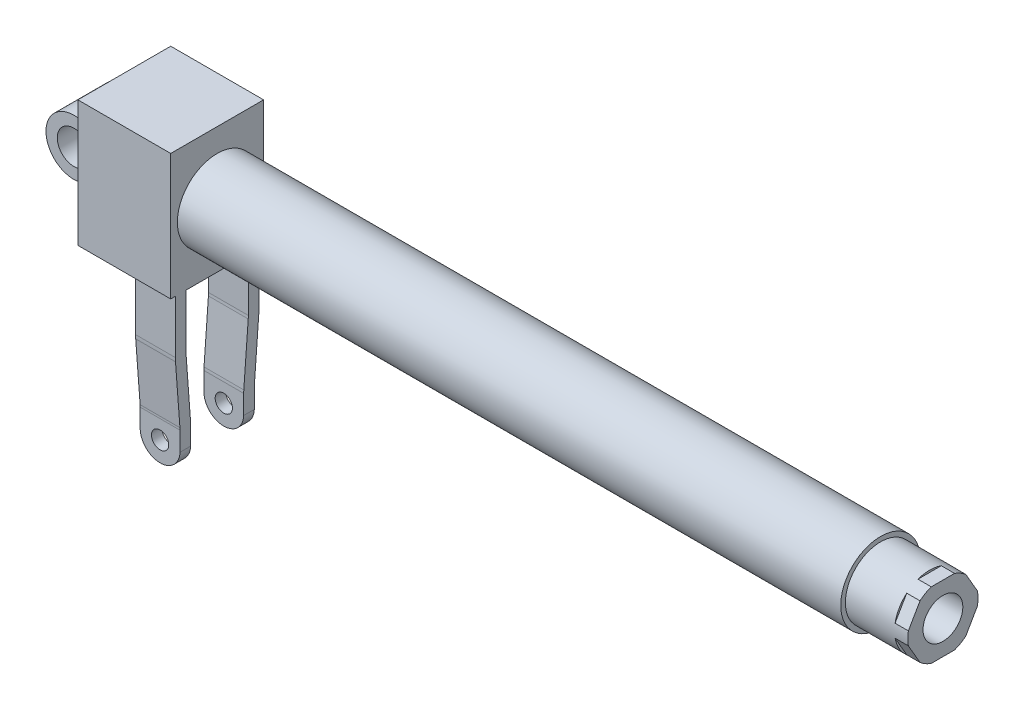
ISO-10303-21;
HEADER;
FILE_DESCRIPTION(('STEP AP214'),'2;1');
FILE_NAME('part.step','',(''),(''),'','','');
FILE_SCHEMA(('AUTOMOTIVE_DESIGN { 1 0 10303 214 1 1 1 1 }'));
ENDSEC;
DATA;
#1=APPLICATION_CONTEXT('core data for automotive mechanical design processes');
#2=APPLICATION_PROTOCOL_DEFINITION('international standard','automotive_design',2000,#1);
#3=PRODUCT_CONTEXT('',#1,'mechanical');
#4=PRODUCT('Part','Part','',(#3));
#5=PRODUCT_RELATED_PRODUCT_CATEGORY('part','',(#4));
#6=PRODUCT_DEFINITION_FORMATION('','',#4);
#7=PRODUCT_DEFINITION_CONTEXT('part definition',#1,'design');
#8=PRODUCT_DEFINITION('design','',#6,#7);
#9=PRODUCT_DEFINITION_SHAPE('','',#8);
#10=(LENGTH_UNIT() NAMED_UNIT(*) SI_UNIT(.MILLI.,.METRE.));
#11=(NAMED_UNIT(*) PLANE_ANGLE_UNIT() SI_UNIT($,.RADIAN.));
#12=(NAMED_UNIT(*) SI_UNIT($,.STERADIAN.) SOLID_ANGLE_UNIT());
#13=UNCERTAINTY_MEASURE_WITH_UNIT(LENGTH_MEASURE(1.E-05),#10,'distance_accuracy_value','');
#14=(GEOMETRIC_REPRESENTATION_CONTEXT(3) GLOBAL_UNCERTAINTY_ASSIGNED_CONTEXT((#13)) GLOBAL_UNIT_ASSIGNED_CONTEXT((#10,
#11,#12)) REPRESENTATION_CONTEXT('',''));
#15=CARTESIAN_POINT('',(0.,0.,0.));
#16=DIRECTION('',(0.,0.,1.));
#17=DIRECTION('',(1.,0.,0.));
#18=AXIS2_PLACEMENT_3D('',#15,#16,#17);
#19=CARTESIAN_POINT('',(88.,0.,0.));
#20=DIRECTION('',(1.,0.,0.));
#21=DIRECTION('',(0.,0.,-1.));
#22=AXIS2_PLACEMENT_3D('',#19,#20,#21);
#23=PLANE('',#22);
#24=CARTESIAN_POINT('',(88.,0.,0.));
#25=DIRECTION('',(-1.,0.,0.));
#26=DIRECTION('',(0.,0.,1.));
#27=AXIS2_PLACEMENT_3D('',#24,#25,#26);
#28=CIRCLE('',#27,20.);
#29=CARTESIAN_POINT('',(88.,0.,20.));
#30=VERTEX_POINT('',#29);
#31=EDGE_CURVE('E19',#30,#30,#28,.F.);
#32=ORIENTED_EDGE('',*,*,#31,.T.);
#33=EDGE_LOOP('',(#32));
#34=FACE_BOUND('',#33,.T.);
#35=ADVANCED_FACE('F15',(#34),#23,.T.);
#36=CARTESIAN_POINT('',(538.,0.,0.));
#37=DIRECTION('',(-1.,0.,0.));
#38=DIRECTION('',(0.,0.,1.));
#39=AXIS2_PLACEMENT_3D('',#36,#37,#38);
#40=CYLINDRICAL_SURFACE('',#39,20.);
#41=ORIENTED_EDGE('',*,*,#31,.F.);
#42=EDGE_LOOP('',(#41));
#43=FACE_BOUND('',#42,.T.);
#44=CARTESIAN_POINT('',(538.,0.,0.));
#45=DIRECTION('',(-1.,0.,0.));
#46=DIRECTION('',(0.,0.,1.));
#47=AXIS2_PLACEMENT_3D('',#44,#45,#46);
#48=CIRCLE('',#47,20.);
#49=CARTESIAN_POINT('',(538.,0.,20.));
#50=VERTEX_POINT('',#49);
#51=EDGE_CURVE('E396',#50,#50,#48,.F.);
#52=ORIENTED_EDGE('',*,*,#51,.T.);
#53=EDGE_LOOP('',(#52));
#54=FACE_BOUND('',#53,.T.);
#55=ADVANCED_FACE('F404',(#43,#54),#40,.F.);
#56=CARTESIAN_POINT('',(538.,0.,0.));
#57=DIRECTION('',(1.,0.,0.));
#58=DIRECTION('',(0.,0.,-1.));
#59=AXIS2_PLACEMENT_3D('',#56,#57,#58);
#60=PLANE('',#59);
#61=ORIENTED_EDGE('',*,*,#51,.F.);
#62=EDGE_LOOP('',(#61));
#63=FACE_BOUND('',#62,.T.);
#64=CARTESIAN_POINT('',(538.,0.,0.));
#65=DIRECTION('',(-1.,0.,0.));
#66=DIRECTION('',(0.,0.,1.));
#67=AXIS2_PLACEMENT_3D('',#64,#65,#66);
#68=CIRCLE('',#67,15.);
#69=CARTESIAN_POINT('',(538.,0.,15.));
#70=VERTEX_POINT('',#69);
#71=EDGE_CURVE('E394',#70,#70,#68,.F.);
#72=ORIENTED_EDGE('',*,*,#71,.T.);
#73=EDGE_LOOP('',(#72));
#74=FACE_BOUND('',#73,.T.);
#75=ADVANCED_FACE('F406',(#63,#74),#60,.F.);
#76=CARTESIAN_POINT('',(0.,0.,20.));
#77=DIRECTION('',(0.,0.,-1.));
#78=DIRECTION('',(-1.,0.,0.));
#79=AXIS2_PLACEMENT_3D('',#76,#77,#78);
#80=CYLINDRICAL_SURFACE('',#79,12.5);
#81=CARTESIAN_POINT('',(0.,0.,20.));
#82=DIRECTION('',(0.,0.,-1.));
#83=DIRECTION('',(-1.,0.,0.));
#84=AXIS2_PLACEMENT_3D('',#81,#82,#83);
#85=CIRCLE('',#84,12.5);
#86=CARTESIAN_POINT('',(-12.5,0.,20.));
#87=VERTEX_POINT('',#86);
#88=EDGE_CURVE('E215',#87,#87,#85,.T.);
#89=ORIENTED_EDGE('',*,*,#88,.F.);
#90=EDGE_LOOP('',(#89));
#91=FACE_BOUND('',#90,.T.);
#92=CARTESIAN_POINT('',(0.,0.,-20.));
#93=DIRECTION('',(0.,0.,-1.));
#94=DIRECTION('',(-1.,0.,0.));
#95=AXIS2_PLACEMENT_3D('',#92,#93,#94);
#96=CIRCLE('',#95,12.5);
#97=CARTESIAN_POINT('',(-12.5,0.,-20.));
#98=VERTEX_POINT('',#97);
#99=EDGE_CURVE('E216',#98,#98,#96,.T.);
#100=ORIENTED_EDGE('',*,*,#99,.T.);
#101=EDGE_LOOP('',(#100));
#102=FACE_BOUND('',#101,.T.);
#103=ADVANCED_FACE('F413',(#91,#102),#80,.F.);
#104=CARTESIAN_POINT('',(635.,0.,0.));
#105=DIRECTION('',(-1.,0.,0.));
#106=DIRECTION('',(0.,0.,1.));
#107=AXIS2_PLACEMENT_3D('',#104,#105,#106);
#108=CYLINDRICAL_SURFACE('',#107,15.);
#109=CARTESIAN_POINT('',(635.,0.,0.));
#110=DIRECTION('',(-1.,0.,0.));
#111=DIRECTION('',(0.,0.,1.));
#112=AXIS2_PLACEMENT_3D('',#109,#110,#111);
#113=CIRCLE('',#112,15.);
#114=CARTESIAN_POINT('',(635.,0.,15.));
#115=VERTEX_POINT('',#114);
#116=EDGE_CURVE('E383',#115,#115,#113,.T.);
#117=ORIENTED_EDGE('',*,*,#116,.F.);
#118=EDGE_LOOP('',(#117));
#119=FACE_BOUND('',#118,.T.);
#120=ORIENTED_EDGE('',*,*,#71,.F.);
#121=EDGE_LOOP('',(#120));
#122=FACE_BOUND('',#121,.T.);
#123=ADVANCED_FACE('F655',(#119,#122),#108,.F.);
#124=CARTESIAN_POINT('',(0.,0.,-20.));
#125=DIRECTION('',(0.,0.,1.));
#126=DIRECTION('',(1.,0.,0.));
#127=AXIS2_PLACEMENT_3D('',#124,#125,#126);
#128=PLANE('',#127);
#129=CARTESIAN_POINT('',(0.,0.,-20.));
#130=DIRECTION('',(0.,0.,-1.));
#131=DIRECTION('',(-1.,0.,0.));
#132=AXIS2_PLACEMENT_3D('',#129,#130,#131);
#133=CIRCLE('',#132,21.);
#134=CARTESIAN_POINT('',(18.,10.816653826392,-20.));
#135=VERTEX_POINT('',#134);
#136=CARTESIAN_POINT('',(18.,-10.816653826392,-20.));
#137=VERTEX_POINT('',#136);
#138=EDGE_CURVE('E209',#135,#137,#133,.F.);
#139=ORIENTED_EDGE('',*,*,#138,.F.);
#140=DIRECTION('',(0.,1.,0.));
#141=VECTOR('',#140,1.);
#142=CARTESIAN_POINT('',(18.,47.5,-20.));
#143=LINE('',#142,#141);
#144=EDGE_CURVE('E207',#135,#137,#143,.F.);
#145=ORIENTED_EDGE('',*,*,#144,.T.);
#146=EDGE_LOOP('',(#139,#145));
#147=FACE_BOUND('',#146,.T.);
#148=ORIENTED_EDGE('',*,*,#99,.F.);
#149=EDGE_LOOP('',(#148));
#150=FACE_BOUND('',#149,.T.);
#151=ADVANCED_FACE('F211',(#147,#150),#128,.F.);
#152=CARTESIAN_POINT('',(0.,0.,20.));
#153=DIRECTION('',(0.,0.,-1.));
#154=DIRECTION('',(-1.,0.,0.));
#155=AXIS2_PLACEMENT_3D('',#152,#153,#154);
#156=CYLINDRICAL_SURFACE('',#155,21.);
#157=ORIENTED_EDGE('',*,*,#138,.T.);
#158=DIRECTION('',(0.,0.,1.));
#159=VECTOR('',#158,1.);
#160=CARTESIAN_POINT('',(18.,-10.816653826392,35.));
#161=LINE('',#160,#159);
#162=CARTESIAN_POINT('',(18.,-10.816653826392,20.));
#163=VERTEX_POINT('',#162);
#164=EDGE_CURVE('E230',#137,#163,#161,.T.);
#165=ORIENTED_EDGE('',*,*,#164,.T.);
#166=CARTESIAN_POINT('',(0.,0.,20.));
#167=DIRECTION('',(0.,0.,-1.));
#168=DIRECTION('',(-1.,0.,0.));
#169=AXIS2_PLACEMENT_3D('',#166,#167,#168);
#170=CIRCLE('',#169,21.);
#171=CARTESIAN_POINT('',(18.,10.816653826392,20.));
#172=VERTEX_POINT('',#171);
#173=EDGE_CURVE('E222',#172,#163,#170,.F.);
#174=ORIENTED_EDGE('',*,*,#173,.F.);
#175=DIRECTION('',(0.,0.,1.));
#176=VECTOR('',#175,1.);
#177=CARTESIAN_POINT('',(18.,10.816653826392,35.));
#178=LINE('',#177,#176);
#179=EDGE_CURVE('E219',#172,#135,#178,.F.);
#180=ORIENTED_EDGE('',*,*,#179,.T.);
#181=EDGE_LOOP('',(#157,#165,#174,#180));
#182=FACE_BOUND('',#181,.T.);
#183=ADVANCED_FACE('F220',(#182),#156,.T.);
#184=CARTESIAN_POINT('',(0.,0.,20.));
#185=DIRECTION('',(0.,0.,1.));
#186=DIRECTION('',(1.,0.,0.));
#187=AXIS2_PLACEMENT_3D('',#184,#185,#186);
#188=PLANE('',#187);
#189=ORIENTED_EDGE('',*,*,#173,.T.);
#190=DIRECTION('',(0.,1.,0.));
#191=VECTOR('',#190,1.);
#192=CARTESIAN_POINT('',(18.,47.5,20.));
#193=LINE('',#192,#191);
#194=EDGE_CURVE('E232',#163,#172,#193,.T.);
#195=ORIENTED_EDGE('',*,*,#194,.T.);
#196=EDGE_LOOP('',(#189,#195));
#197=FACE_BOUND('',#196,.T.);
#198=ORIENTED_EDGE('',*,*,#88,.T.);
#199=EDGE_LOOP('',(#198));
#200=FACE_BOUND('',#199,.T.);
#201=ADVANCED_FACE('F646',(#197,#200),#188,.T.);
#202=CARTESIAN_POINT('',(625.,1.39362205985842E-13,0.));
#203=DIRECTION('',(1.,0.,0.));
#204=DIRECTION('',(0.,1.,0.));
#205=AXIS2_PLACEMENT_3D('',#202,#203,#204);
#206=PLANE('',#205);
#207=CARTESIAN_POINT('',(625.,2.3573979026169E-13,0.));
#208=DIRECTION('',(-1.,0.,0.));
#209=DIRECTION('',(0.,-1.,0.));
#210=AXIS2_PLACEMENT_3D('',#207,#208,#209);
#211=CIRCLE('',#210,26.5);
#212=CARTESIAN_POINT('',(625.,20.1116686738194,-17.2560361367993));
#213=VERTEX_POINT('',#212);
#214=CARTESIAN_POINT('',(625.,4.88833132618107,-26.0452340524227));
#215=VERTEX_POINT('',#214);
#216=EDGE_CURVE('E367',#213,#215,#211,.T.);
#217=ORIENTED_EDGE('',*,*,#216,.F.);
#218=DIRECTION('',(0.,0.866025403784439,0.5));
#219=VECTOR('',#218,1.);
#220=CARTESIAN_POINT('',(625.,2.7390370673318E-13,-28.8675134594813));
#221=LINE('',#220,#219);
#222=EDGE_CURVE('E389',#215,#213,#221,.T.);
#223=ORIENTED_EDGE('',*,*,#222,.F.);
#224=EDGE_LOOP('',(#217,#223));
#225=FACE_BOUND('',#224,.T.);
#226=ADVANCED_FACE('F649',(#225),#206,.T.);
#227=CARTESIAN_POINT('',(625.,2.7390370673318E-13,-28.8675134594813));
#228=DIRECTION('',(0.,0.5,-0.866025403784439));
#229=DIRECTION('',(0.,0.866025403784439,0.5));
#230=AXIS2_PLACEMENT_3D('',#227,#228,#229);
#231=PLANE('',#230);
#232=DIRECTION('',(-1.,0.,0.));
#233=VECTOR('',#232,1.);
#234=CARTESIAN_POINT('',(635.,20.1116686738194,-17.2560361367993));
#235=LINE('',#234,#233);
#236=CARTESIAN_POINT('',(635.,20.1116686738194,-17.2560361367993));
#237=VERTEX_POINT('',#236);
#238=EDGE_CURVE('E370',#237,#213,#235,.T.);
#239=ORIENTED_EDGE('',*,*,#238,.F.);
#240=DIRECTION('',(0.,0.866025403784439,0.499999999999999));
#241=VECTOR('',#240,1.);
#242=CARTESIAN_POINT('',(635.,4.88833132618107,-26.0452340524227));
#243=LINE('',#242,#241);
#244=CARTESIAN_POINT('',(635.,4.88833132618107,-26.0452340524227));
#245=VERTEX_POINT('',#244);
#246=EDGE_CURVE('E387',#245,#237,#243,.T.);
#247=ORIENTED_EDGE('',*,*,#246,.F.);
#248=DIRECTION('',(-1.,0.,0.));
#249=VECTOR('',#248,1.);
#250=CARTESIAN_POINT('',(635.,4.88833132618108,-26.0452340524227));
#251=LINE('',#250,#249);
#252=EDGE_CURVE('E366',#215,#245,#251,.F.);
#253=ORIENTED_EDGE('',*,*,#252,.F.);
#254=ORIENTED_EDGE('',*,*,#222,.T.);
#255=EDGE_LOOP('',(#239,#247,#253,#254));
#256=FACE_BOUND('',#255,.T.);
#257=ADVANCED_FACE('F670',(#256),#231,.T.);
#258=CARTESIAN_POINT('',(625.,1.39362205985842E-13,0.));
#259=DIRECTION('',(1.,0.,0.));
#260=DIRECTION('',(0.,1.,0.));
#261=AXIS2_PLACEMENT_3D('',#258,#259,#260);
#262=PLANE('',#261);
#263=CARTESIAN_POINT('',(625.,2.3573979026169E-13,0.));
#264=DIRECTION('',(-1.,0.,0.));
#265=DIRECTION('',(0.,-1.,0.));
#266=AXIS2_PLACEMENT_3D('',#263,#264,#265);
#267=CIRCLE('',#266,26.5);
#268=CARTESIAN_POINT('',(625.,-4.88833132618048,-26.0452340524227));
#269=VERTEX_POINT('',#268);
#270=CARTESIAN_POINT('',(625.,-20.111668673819,-17.2560361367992));
#271=VERTEX_POINT('',#270);
#272=EDGE_CURVE('E359',#269,#271,#267,.T.);
#273=ORIENTED_EDGE('',*,*,#272,.F.);
#274=DIRECTION('',(0.,0.866025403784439,-0.5));
#275=VECTOR('',#274,1.);
#276=CARTESIAN_POINT('',(625.,-24.9999999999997,-14.4337567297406));
#277=LINE('',#276,#275);
#278=EDGE_CURVE('E629',#271,#269,#277,.T.);
#279=ORIENTED_EDGE('',*,*,#278,.F.);
#280=EDGE_LOOP('',(#273,#279));
#281=FACE_BOUND('',#280,.T.);
#282=ADVANCED_FACE('F674',(#281),#262,.T.);
#283=CARTESIAN_POINT('',(625.,-24.9999999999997,-14.4337567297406));
#284=DIRECTION('',(0.,-0.5,-0.866025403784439));
#285=DIRECTION('',(0.,0.866025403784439,-0.5));
#286=AXIS2_PLACEMENT_3D('',#283,#284,#285);
#287=PLANE('',#286);
#288=DIRECTION('',(-1.,0.,0.));
#289=VECTOR('',#288,1.);
#290=CARTESIAN_POINT('',(635.,-4.88833132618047,-26.0452340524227));
#291=LINE('',#290,#289);
#292=CARTESIAN_POINT('',(635.,-4.88833132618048,-26.0452340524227));
#293=VERTEX_POINT('',#292);
#294=EDGE_CURVE('E362',#293,#269,#291,.T.);
#295=ORIENTED_EDGE('',*,*,#294,.F.);
#296=DIRECTION('',(0.,0.866025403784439,-0.5));
#297=VECTOR('',#296,1.);
#298=CARTESIAN_POINT('',(635.,-20.111668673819,-17.2560361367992));
#299=LINE('',#298,#297);
#300=CARTESIAN_POINT('',(635.,-20.111668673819,-17.2560361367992));
#301=VERTEX_POINT('',#300);
#302=EDGE_CURVE('E866',#301,#293,#299,.T.);
#303=ORIENTED_EDGE('',*,*,#302,.F.);
#304=DIRECTION('',(-1.,0.,0.));
#305=VECTOR('',#304,1.);
#306=CARTESIAN_POINT('',(635.,-20.111668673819,-17.2560361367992));
#307=LINE('',#306,#305);
#308=EDGE_CURVE('E358',#271,#301,#307,.F.);
#309=ORIENTED_EDGE('',*,*,#308,.F.);
#310=ORIENTED_EDGE('',*,*,#278,.T.);
#311=EDGE_LOOP('',(#295,#303,#309,#310));
#312=FACE_BOUND('',#311,.T.);
#313=ADVANCED_FACE('F678',(#312),#287,.T.);
#314=CARTESIAN_POINT('',(625.,1.39362205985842E-13,0.));
#315=DIRECTION('',(1.,0.,0.));
#316=DIRECTION('',(0.,1.,0.));
#317=AXIS2_PLACEMENT_3D('',#314,#315,#316);
#318=PLANE('',#317);
#319=CARTESIAN_POINT('',(625.,2.3573979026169E-13,0.));
#320=DIRECTION('',(-1.,0.,0.));
#321=DIRECTION('',(0.,-1.,0.));
#322=AXIS2_PLACEMENT_3D('',#319,#320,#321);
#323=CIRCLE('',#322,26.5);
#324=CARTESIAN_POINT('',(625.,25.0000000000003,8.78919791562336));
#325=VERTEX_POINT('',#324);
#326=CARTESIAN_POINT('',(625.,25.0000000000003,-8.78919791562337));
#327=VERTEX_POINT('',#326);
#328=EDGE_CURVE('E352',#325,#327,#323,.T.);
#329=ORIENTED_EDGE('',*,*,#328,.F.);
#330=DIRECTION('',(0.,0.,1.));
#331=VECTOR('',#330,1.);
#332=CARTESIAN_POINT('',(625.,25.0000000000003,-14.4337567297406));
#333=LINE('',#332,#331);
#334=EDGE_CURVE('E386',#327,#325,#333,.T.);
#335=ORIENTED_EDGE('',*,*,#334,.F.);
#336=EDGE_LOOP('',(#329,#335));
#337=FACE_BOUND('',#336,.T.);
#338=ADVANCED_FACE('F682',(#337),#318,.T.);
#339=CARTESIAN_POINT('',(625.,1.39362205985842E-13,0.));
#340=DIRECTION('',(1.,0.,0.));
#341=DIRECTION('',(0.,1.,0.));
#342=AXIS2_PLACEMENT_3D('',#339,#340,#341);
#343=PLANE('',#342);
#344=CARTESIAN_POINT('',(625.,2.3573979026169E-13,0.));
#345=DIRECTION('',(-1.,0.,0.));
#346=DIRECTION('',(0.,-1.,0.));
#347=AXIS2_PLACEMENT_3D('',#344,#345,#346);
#348=CIRCLE('',#347,26.5);
#349=CARTESIAN_POINT('',(625.,-24.9999999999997,-8.7891979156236));
#350=VERTEX_POINT('',#349);
#351=CARTESIAN_POINT('',(625.,-24.9999999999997,8.78919791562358));
#352=VERTEX_POINT('',#351);
#353=EDGE_CURVE('E349',#350,#352,#348,.T.);
#354=ORIENTED_EDGE('',*,*,#353,.F.);
#355=DIRECTION('',(0.,0.,1.));
#356=VECTOR('',#355,1.);
#357=CARTESIAN_POINT('',(625.,-24.9999999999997,14.4337567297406));
#358=LINE('',#357,#356);
#359=EDGE_CURVE('E622',#352,#350,#358,.F.);
#360=ORIENTED_EDGE('',*,*,#359,.F.);
#361=EDGE_LOOP('',(#354,#360));
#362=FACE_BOUND('',#361,.T.);
#363=ADVANCED_FACE('F686',(#362),#343,.T.);
#364=CARTESIAN_POINT('',(625.,-24.9999999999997,14.4337567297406));
#365=DIRECTION('',(0.,-1.,0.));
#366=DIRECTION('',(1.,0.,0.));
#367=AXIS2_PLACEMENT_3D('',#364,#365,#366);
#368=PLANE('',#367);
#369=DIRECTION('',(-1.,0.,0.));
#370=VECTOR('',#369,1.);
#371=CARTESIAN_POINT('',(635.,-24.9999999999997,-8.78919791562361));
#372=LINE('',#371,#370);
#373=CARTESIAN_POINT('',(635.,-24.9999999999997,-8.7891979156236));
#374=VERTEX_POINT('',#373);
#375=EDGE_CURVE('E354',#374,#350,#372,.T.);
#376=ORIENTED_EDGE('',*,*,#375,.F.);
#377=DIRECTION('',(0.,0.,1.));
#378=VECTOR('',#377,1.);
#379=CARTESIAN_POINT('',(635.,-24.9999999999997,0.));
#380=LINE('',#379,#378);
#381=CARTESIAN_POINT('',(635.,-24.9999999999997,8.78919791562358));
#382=VERTEX_POINT('',#381);
#383=EDGE_CURVE('E868',#382,#374,#380,.F.);
#384=ORIENTED_EDGE('',*,*,#383,.F.);
#385=DIRECTION('',(-1.,0.,0.));
#386=VECTOR('',#385,1.);
#387=CARTESIAN_POINT('',(635.,-24.9999999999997,8.78919791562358));
#388=LINE('',#387,#386);
#389=EDGE_CURVE('E348',#352,#382,#388,.F.);
#390=ORIENTED_EDGE('',*,*,#389,.F.);
#391=ORIENTED_EDGE('',*,*,#359,.T.);
#392=EDGE_LOOP('',(#376,#384,#390,#391));
#393=FACE_BOUND('',#392,.T.);
#394=ADVANCED_FACE('F690',(#393),#368,.T.);
#395=CARTESIAN_POINT('',(625.,1.39362205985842E-13,0.));
#396=DIRECTION('',(1.,0.,0.));
#397=DIRECTION('',(0.,1.,0.));
#398=AXIS2_PLACEMENT_3D('',#395,#396,#397);
#399=PLANE('',#398);
#400=CARTESIAN_POINT('',(625.,2.3573979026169E-13,0.));
#401=DIRECTION('',(-1.,0.,0.));
#402=DIRECTION('',(0.,-1.,0.));
#403=AXIS2_PLACEMENT_3D('',#400,#401,#402);
#404=CIRCLE('',#403,26.5);
#405=CARTESIAN_POINT('',(625.,-20.111668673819,17.2560361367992));
#406=VERTEX_POINT('',#405);
#407=CARTESIAN_POINT('',(625.,-4.88833132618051,26.0452340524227));
#408=VERTEX_POINT('',#407);
#409=EDGE_CURVE('E341',#406,#408,#404,.T.);
#410=ORIENTED_EDGE('',*,*,#409,.F.);
#411=DIRECTION('',(0.,-0.866025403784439,-0.5));
#412=VECTOR('',#411,1.);
#413=CARTESIAN_POINT('',(625.,2.7390370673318E-13,28.8675134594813));
#414=LINE('',#413,#412);
#415=EDGE_CURVE('E616',#408,#406,#414,.T.);
#416=ORIENTED_EDGE('',*,*,#415,.F.);
#417=EDGE_LOOP('',(#410,#416));
#418=FACE_BOUND('',#417,.T.);
#419=ADVANCED_FACE('F694',(#418),#399,.T.);
#420=CARTESIAN_POINT('',(625.,2.7390370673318E-13,28.8675134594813));
#421=DIRECTION('',(0.,-0.5,0.866025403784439));
#422=DIRECTION('',(0.,-0.866025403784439,-0.5));
#423=AXIS2_PLACEMENT_3D('',#420,#421,#422);
#424=PLANE('',#423);
#425=DIRECTION('',(-1.,0.,0.));
#426=VECTOR('',#425,1.);
#427=CARTESIAN_POINT('',(635.,-20.111668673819,17.2560361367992));
#428=LINE('',#427,#426);
#429=CARTESIAN_POINT('',(635.,-20.111668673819,17.2560361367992));
#430=VERTEX_POINT('',#429);
#431=EDGE_CURVE('E344',#430,#406,#428,.T.);
#432=ORIENTED_EDGE('',*,*,#431,.F.);
#433=DIRECTION('',(0.,-0.866025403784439,-0.5));
#434=VECTOR('',#433,1.);
#435=CARTESIAN_POINT('',(635.,-4.8883313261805,26.0452340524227));
#436=LINE('',#435,#434);
#437=CARTESIAN_POINT('',(635.,-4.88833132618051,26.0452340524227));
#438=VERTEX_POINT('',#437);
#439=EDGE_CURVE('E875',#438,#430,#436,.T.);
#440=ORIENTED_EDGE('',*,*,#439,.F.);
#441=DIRECTION('',(-1.,0.,0.));
#442=VECTOR('',#441,1.);
#443=CARTESIAN_POINT('',(635.,-4.88833132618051,26.0452340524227));
#444=LINE('',#443,#442);
#445=EDGE_CURVE('E340',#408,#438,#444,.F.);
#446=ORIENTED_EDGE('',*,*,#445,.F.);
#447=ORIENTED_EDGE('',*,*,#415,.T.);
#448=EDGE_LOOP('',(#432,#440,#446,#447));
#449=FACE_BOUND('',#448,.T.);
#450=ADVANCED_FACE('F698',(#449),#424,.T.);
#451=CARTESIAN_POINT('',(625.,1.39362205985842E-13,0.));
#452=DIRECTION('',(1.,0.,0.));
#453=DIRECTION('',(0.,1.,0.));
#454=AXIS2_PLACEMENT_3D('',#451,#452,#453);
#455=PLANE('',#454);
#456=CARTESIAN_POINT('',(625.,2.3573979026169E-13,0.));
#457=DIRECTION('',(-1.,0.,0.));
#458=DIRECTION('',(0.,-1.,0.));
#459=AXIS2_PLACEMENT_3D('',#456,#457,#458);
#460=CIRCLE('',#459,26.5);
#461=CARTESIAN_POINT('',(625.,4.88833132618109,26.0452340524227));
#462=VERTEX_POINT('',#461);
#463=CARTESIAN_POINT('',(625.,20.1116686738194,17.2560361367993));
#464=VERTEX_POINT('',#463);
#465=EDGE_CURVE('E333',#462,#464,#460,.T.);
#466=ORIENTED_EDGE('',*,*,#465,.F.);
#467=DIRECTION('',(0.,-0.866025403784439,0.5));
#468=VECTOR('',#467,1.);
#469=CARTESIAN_POINT('',(625.,25.0000000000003,14.4337567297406));
#470=LINE('',#469,#468);
#471=EDGE_CURVE('E613',#464,#462,#470,.T.);
#472=ORIENTED_EDGE('',*,*,#471,.F.);
#473=EDGE_LOOP('',(#466,#472));
#474=FACE_BOUND('',#473,.T.);
#475=ADVANCED_FACE('F702',(#474),#455,.T.);
#476=CARTESIAN_POINT('',(625.,25.0000000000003,14.4337567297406));
#477=DIRECTION('',(0.,0.5,0.866025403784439));
#478=DIRECTION('',(0.,-0.866025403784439,0.5));
#479=AXIS2_PLACEMENT_3D('',#476,#477,#478);
#480=PLANE('',#479);
#481=DIRECTION('',(-1.,0.,0.));
#482=VECTOR('',#481,1.);
#483=CARTESIAN_POINT('',(635.,4.8883313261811,26.0452340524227));
#484=LINE('',#483,#482);
#485=CARTESIAN_POINT('',(635.,4.88833132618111,26.0452340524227));
#486=VERTEX_POINT('',#485);
#487=EDGE_CURVE('E336',#486,#462,#484,.T.);
#488=ORIENTED_EDGE('',*,*,#487,.F.);
#489=DIRECTION('',(0.,-0.866025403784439,0.5));
#490=VECTOR('',#489,1.);
#491=CARTESIAN_POINT('',(635.,20.1116686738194,17.2560361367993));
#492=LINE('',#491,#490);
#493=CARTESIAN_POINT('',(635.,20.1116686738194,17.2560361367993));
#494=VERTEX_POINT('',#493);
#495=EDGE_CURVE('E615',#494,#486,#492,.T.);
#496=ORIENTED_EDGE('',*,*,#495,.F.);
#497=DIRECTION('',(-1.,0.,0.));
#498=VECTOR('',#497,1.);
#499=CARTESIAN_POINT('',(635.,20.1116686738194,17.2560361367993));
#500=LINE('',#499,#498);
#501=EDGE_CURVE('E332',#464,#494,#500,.F.);
#502=ORIENTED_EDGE('',*,*,#501,.F.);
#503=ORIENTED_EDGE('',*,*,#471,.T.);
#504=EDGE_LOOP('',(#488,#496,#502,#503));
#505=FACE_BOUND('',#504,.T.);
#506=ADVANCED_FACE('F706',(#505),#480,.T.);
#507=CARTESIAN_POINT('',(635.,2.40122249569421E-13,0.));
#508=DIRECTION('',(1.,0.,0.));
#509=DIRECTION('',(0.,1.,0.));
#510=AXIS2_PLACEMENT_3D('',#507,#508,#509);
#511=PLANE('',#510);
#512=ORIENTED_EDGE('',*,*,#116,.T.);
#513=EDGE_LOOP('',(#512));
#514=FACE_BOUND('',#513,.T.);
#515=CARTESIAN_POINT('',(635.,2.40122249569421E-13,0.));
#516=DIRECTION('',(-1.,0.,0.));
#517=DIRECTION('',(0.,-1.,0.));
#518=AXIS2_PLACEMENT_3D('',#515,#516,#517);
#519=CIRCLE('',#518,26.5);
#520=CARTESIAN_POINT('',(635.,25.0000000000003,-8.78919791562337));
#521=VERTEX_POINT('',#520);
#522=EDGE_CURVE('E371',#521,#237,#519,.T.);
#523=ORIENTED_EDGE('',*,*,#522,.F.);
#524=DIRECTION('',(0.,0.,1.));
#525=VECTOR('',#524,1.);
#526=CARTESIAN_POINT('',(635.,25.0000000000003,-14.4337567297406));
#527=LINE('',#526,#525);
#528=CARTESIAN_POINT('',(635.,25.0000000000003,8.78919791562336));
#529=VERTEX_POINT('',#528);
#530=EDGE_CURVE('E382',#529,#521,#527,.F.);
#531=ORIENTED_EDGE('',*,*,#530,.F.);
#532=CARTESIAN_POINT('',(635.,2.40122249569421E-13,0.));
#533=DIRECTION('',(-1.,0.,0.));
#534=DIRECTION('',(0.,-1.,0.));
#535=AXIS2_PLACEMENT_3D('',#532,#533,#534);
#536=CIRCLE('',#535,26.5);
#537=EDGE_CURVE('E328',#494,#529,#536,.T.);
#538=ORIENTED_EDGE('',*,*,#537,.F.);
#539=ORIENTED_EDGE('',*,*,#495,.T.);
#540=CARTESIAN_POINT('',(635.,2.40122249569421E-13,0.));
#541=DIRECTION('',(-1.,0.,0.));
#542=DIRECTION('',(0.,-1.,0.));
#543=AXIS2_PLACEMENT_3D('',#540,#541,#542);
#544=CIRCLE('',#543,26.5);
#545=EDGE_CURVE('E337',#438,#486,#544,.T.);
#546=ORIENTED_EDGE('',*,*,#545,.F.);
#547=ORIENTED_EDGE('',*,*,#439,.T.);
#548=CARTESIAN_POINT('',(635.,2.40122249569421E-13,0.));
#549=DIRECTION('',(-1.,0.,0.));
#550=DIRECTION('',(0.,-1.,0.));
#551=AXIS2_PLACEMENT_3D('',#548,#549,#550);
#552=CIRCLE('',#551,26.5);
#553=EDGE_CURVE('E345',#382,#430,#552,.T.);
#554=ORIENTED_EDGE('',*,*,#553,.F.);
#555=ORIENTED_EDGE('',*,*,#383,.T.);
#556=CARTESIAN_POINT('',(635.,2.40122249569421E-13,0.));
#557=DIRECTION('',(-1.,0.,0.));
#558=DIRECTION('',(0.,-1.,0.));
#559=AXIS2_PLACEMENT_3D('',#556,#557,#558);
#560=CIRCLE('',#559,26.5);
#561=EDGE_CURVE('E355',#301,#374,#560,.T.);
#562=ORIENTED_EDGE('',*,*,#561,.F.);
#563=ORIENTED_EDGE('',*,*,#302,.T.);
#564=CARTESIAN_POINT('',(635.,2.40122249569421E-13,0.));
#565=DIRECTION('',(-1.,0.,0.));
#566=DIRECTION('',(0.,-1.,0.));
#567=AXIS2_PLACEMENT_3D('',#564,#565,#566);
#568=CIRCLE('',#567,26.5);
#569=EDGE_CURVE('E363',#245,#293,#568,.T.);
#570=ORIENTED_EDGE('',*,*,#569,.F.);
#571=ORIENTED_EDGE('',*,*,#246,.T.);
#572=EDGE_LOOP('',(#523,#531,#538,#539,#546,#547,#554,#555,#562,#563,#570,#571));
#573=FACE_BOUND('',#572,.T.);
#574=ADVANCED_FACE('F710',(#514,#573),#511,.T.);
#575=CARTESIAN_POINT('',(625.,25.0000000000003,-14.4337567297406));
#576=DIRECTION('',(0.,1.,0.));
#577=DIRECTION('',(-1.,0.,0.));
#578=AXIS2_PLACEMENT_3D('',#575,#576,#577);
#579=PLANE('',#578);
#580=DIRECTION('',(-1.,0.,0.));
#581=VECTOR('',#580,1.);
#582=CARTESIAN_POINT('',(635.,25.0000000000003,8.78919791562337));
#583=LINE('',#582,#581);
#584=EDGE_CURVE('E331',#529,#325,#583,.T.);
#585=ORIENTED_EDGE('',*,*,#584,.F.);
#586=ORIENTED_EDGE('',*,*,#530,.T.);
#587=DIRECTION('',(-1.,0.,0.));
#588=VECTOR('',#587,1.);
#589=CARTESIAN_POINT('',(635.,25.0000000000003,-8.78919791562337));
#590=LINE('',#589,#588);
#591=EDGE_CURVE('E374',#327,#521,#590,.F.);
#592=ORIENTED_EDGE('',*,*,#591,.F.);
#593=ORIENTED_EDGE('',*,*,#334,.T.);
#594=EDGE_LOOP('',(#585,#586,#592,#593));
#595=FACE_BOUND('',#594,.T.);
#596=ADVANCED_FACE('F714',(#595),#579,.T.);
#597=CARTESIAN_POINT('',(58.0000000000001,-136.618283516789,-50.));
#598=DIRECTION('',(1.,0.,0.));
#599=DIRECTION('',(0.,1.,0.));
#600=AXIS2_PLACEMENT_3D('',#597,#598,#599);
#601=CYLINDRICAL_SURFACE('',#600,22.);
#602=DIRECTION('',(1.,0.,0.));
#603=VECTOR('',#602,1.);
#604=CARTESIAN_POINT('',(58.0000000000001,-136.618283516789,-28.));
#605=LINE('',#604,#603);
#606=CARTESIAN_POINT('',(88.,-136.618283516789,-28.));
#607=VERTEX_POINT('',#606);
#608=CARTESIAN_POINT('',(58.0000000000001,-136.618283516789,-28.));
#609=VERTEX_POINT('',#608);
#610=EDGE_CURVE('E316',#607,#609,#605,.F.);
#611=ORIENTED_EDGE('',*,*,#610,.T.);
#612=CARTESIAN_POINT('',(58.0000000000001,-136.618283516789,-50.));
#613=DIRECTION('',(1.,0.,0.));
#614=DIRECTION('',(0.,1.,0.));
#615=AXIS2_PLACEMENT_3D('',#612,#613,#614);
#616=CIRCLE('',#615,22.);
#617=CARTESIAN_POINT('',(58.0000000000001,-134.98041019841,-28.0610535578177));
#618=VERTEX_POINT('',#617);
#619=EDGE_CURVE('E379',#609,#618,#616,.F.);
#620=ORIENTED_EDGE('',*,*,#619,.T.);
#621=DIRECTION('',(1.,0.,0.));
#622=VECTOR('',#621,1.);
#623=CARTESIAN_POINT('',(58.,-134.98041019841,-28.0610535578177));
#624=LINE('',#623,#622);
#625=CARTESIAN_POINT('',(88.,-134.98041019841,-28.0610535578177));
#626=VERTEX_POINT('',#625);
#627=EDGE_CURVE('E317',#618,#626,#624,.T.);
#628=ORIENTED_EDGE('',*,*,#627,.T.);
#629=CARTESIAN_POINT('',(88.0000000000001,-136.618283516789,-50.));
#630=DIRECTION('',(1.,0.,0.));
#631=DIRECTION('',(0.,1.,0.));
#632=AXIS2_PLACEMENT_3D('',#629,#630,#631);
#633=CIRCLE('',#632,22.);
#634=EDGE_CURVE('E226',#607,#626,#633,.F.);
#635=ORIENTED_EDGE('',*,*,#634,.F.);
#636=EDGE_LOOP('',(#611,#620,#628,#635));
#637=FACE_BOUND('',#636,.T.);
#638=ADVANCED_FACE('F718',(#637),#601,.F.);
#639=CARTESIAN_POINT('',(73.0000000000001,-150.489175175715,-35.));
#640=DIRECTION('',(0.,0.,1.));
#641=DIRECTION('',(1.,0.,0.));
#642=AXIS2_PLACEMENT_3D('',#639,#640,#641);
#643=CYLINDRICAL_SURFACE('',#642,6.50000000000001);
#644=CARTESIAN_POINT('',(73.0000000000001,-150.489175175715,-20.));
#645=DIRECTION('',(0.,0.,1.));
#646=DIRECTION('',(1.,0.,0.));
#647=AXIS2_PLACEMENT_3D('',#644,#645,#646);
#648=CIRCLE('',#647,6.50000000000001);
#649=CARTESIAN_POINT('',(79.5000000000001,-150.489175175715,-20.));
#650=VERTEX_POINT('',#649);
#651=EDGE_CURVE('E306',#650,#650,#648,.F.);
#652=ORIENTED_EDGE('',*,*,#651,.F.);
#653=EDGE_LOOP('',(#652));
#654=FACE_BOUND('',#653,.T.);
#655=CARTESIAN_POINT('',(73.0000000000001,-150.489175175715,-28.));
#656=DIRECTION('',(0.,0.,1.));
#657=DIRECTION('',(1.,0.,0.));
#658=AXIS2_PLACEMENT_3D('',#655,#656,#657);
#659=CIRCLE('',#658,6.50000000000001);
#660=CARTESIAN_POINT('',(79.5000000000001,-150.489175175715,-28.));
#661=VERTEX_POINT('',#660);
#662=EDGE_CURVE('E313',#661,#661,#659,.F.);
#663=ORIENTED_EDGE('',*,*,#662,.T.);
#664=EDGE_LOOP('',(#663));
#665=FACE_BOUND('',#664,.T.);
#666=ADVANCED_FACE('F722',(#654,#665),#643,.F.);
#667=CARTESIAN_POINT('',(18.,47.5,35.));
#668=DIRECTION('',(1.,0.,0.));
#669=DIRECTION('',(0.,1.,0.));
#670=AXIS2_PLACEMENT_3D('',#667,#668,#669);
#671=PLANE('',#670);
#672=ORIENTED_EDGE('',*,*,#164,.F.);
#673=ORIENTED_EDGE('',*,*,#144,.F.);
#674=ORIENTED_EDGE('',*,*,#179,.F.);
#675=ORIENTED_EDGE('',*,*,#194,.F.);
#676=EDGE_LOOP('',(#672,#673,#674,#675));
#677=FACE_BOUND('',#676,.T.);
#678=DIRECTION('',(0.,0.,1.));
#679=VECTOR('',#678,1.);
#680=CARTESIAN_POINT('',(18.,-47.5,35.));
#681=LINE('',#680,#679);
#682=CARTESIAN_POINT('',(18.,-47.5,-35.));
#683=VERTEX_POINT('',#682);
#684=CARTESIAN_POINT('',(18.,-47.5,35.));
#685=VERTEX_POINT('',#684);
#686=EDGE_CURVE('E505',#683,#685,#681,.T.);
#687=ORIENTED_EDGE('',*,*,#686,.T.);
#688=DIRECTION('',(0.,1.,0.));
#689=VECTOR('',#688,1.);
#690=CARTESIAN_POINT('',(18.,-47.5,35.));
#691=LINE('',#690,#689);
#692=CARTESIAN_POINT('',(18.,47.5,35.));
#693=VERTEX_POINT('',#692);
#694=EDGE_CURVE('E528',#693,#685,#691,.F.);
#695=ORIENTED_EDGE('',*,*,#694,.F.);
#696=DIRECTION('',(0.,0.,-1.));
#697=VECTOR('',#696,1.);
#698=CARTESIAN_POINT('',(18.,47.5,35.));
#699=LINE('',#698,#697);
#700=CARTESIAN_POINT('',(18.,47.5,-35.));
#701=VERTEX_POINT('',#700);
#702=EDGE_CURVE('E517',#693,#701,#699,.T.);
#703=ORIENTED_EDGE('',*,*,#702,.T.);
#704=DIRECTION('',(0.,1.,0.));
#705=VECTOR('',#704,1.);
#706=CARTESIAN_POINT('',(18.,-47.5,-35.));
#707=LINE('',#706,#705);
#708=EDGE_CURVE('E516',#701,#683,#707,.F.);
#709=ORIENTED_EDGE('',*,*,#708,.T.);
#710=EDGE_LOOP('',(#687,#695,#703,#709));
#711=FACE_BOUND('',#710,.T.);
#712=ADVANCED_FACE('F228',(#677,#711),#671,.F.);
#713=CARTESIAN_POINT('',(58.0000000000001,-136.618283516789,-50.));
#714=DIRECTION('',(1.,0.,0.));
#715=DIRECTION('',(0.,1.,0.));
#716=AXIS2_PLACEMENT_3D('',#713,#714,#715);
#717=PLANE('',#716);
#718=DIRECTION('',(0.,0.,-1.));
#719=VECTOR('',#718,1.);
#720=CARTESIAN_POINT('',(58.0000000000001,-151.059141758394,895.946011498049));
#721=LINE('',#720,#719);
#722=CARTESIAN_POINT('',(58.0000000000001,-151.059141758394,-20.));
#723=VERTEX_POINT('',#722);
#724=CARTESIAN_POINT('',(58.0000000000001,-151.059141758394,-28.));
#725=VERTEX_POINT('',#724);
#726=EDGE_CURVE('E312',#723,#725,#721,.T.);
#727=ORIENTED_EDGE('',*,*,#726,.F.);
#728=DIRECTION('',(0.,1.,0.));
#729=VECTOR('',#728,1.);
#730=CARTESIAN_POINT('',(58.0000000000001,-136.618283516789,-20.));
#731=LINE('',#730,#729);
#732=CARTESIAN_POINT('',(58.0000000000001,-136.618283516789,-20.));
#733=VERTEX_POINT('',#732);
#734=EDGE_CURVE('E302',#733,#723,#731,.F.);
#735=ORIENTED_EDGE('',*,*,#734,.F.);
#736=CARTESIAN_POINT('',(58.0000000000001,-136.618283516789,-50.));
#737=DIRECTION('',(1.,0.,0.));
#738=DIRECTION('',(0.,1.,0.));
#739=AXIS2_PLACEMENT_3D('',#736,#737,#738);
#740=CIRCLE('',#739,30.);
#741=CARTESIAN_POINT('',(58.0000000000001,-134.384819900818,-20.0832548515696));
#742=VERTEX_POINT('',#741);
#743=EDGE_CURVE('E298',#742,#733,#740,.T.);
#744=ORIENTED_EDGE('',*,*,#743,.F.);
#745=DIRECTION('',(0.,-0.997224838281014,0.0744487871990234));
#746=VECTOR('',#745,1.);
#747=CARTESIAN_POINT('',(58.,-89.7334636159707,-23.4167451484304));
#748=LINE('',#747,#746);
#749=CARTESIAN_POINT('',(58.,-89.7334636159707,-23.4167451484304));
#750=VERTEX_POINT('',#749);
#751=EDGE_CURVE('E476',#750,#742,#748,.T.);
#752=ORIENTED_EDGE('',*,*,#751,.F.);
#753=CARTESIAN_POINT('',(58.,-87.5,6.5));
#754=DIRECTION('',(1.,0.,0.));
#755=DIRECTION('',(0.,1.,0.));
#756=AXIS2_PLACEMENT_3D('',#753,#754,#755);
#757=CIRCLE('',#756,30.);
#758=CARTESIAN_POINT('',(58.,-87.5,-23.5));
#759=VERTEX_POINT('',#758);
#760=EDGE_CURVE('E294',#750,#759,#757,.T.);
#761=ORIENTED_EDGE('',*,*,#760,.T.);
#762=DIRECTION('',(0.,1.,0.));
#763=VECTOR('',#762,1.);
#764=CARTESIAN_POINT('',(58.,-47.5,-23.5));
#765=LINE('',#764,#763);
#766=CARTESIAN_POINT('',(58.,-47.5,-23.5));
#767=VERTEX_POINT('',#766);
#768=EDGE_CURVE('E296',#767,#759,#765,.F.);
#769=ORIENTED_EDGE('',*,*,#768,.F.);
#770=DIRECTION('',(0.,0.,1.));
#771=VECTOR('',#770,1.);
#772=CARTESIAN_POINT('',(58.,-47.5,35.));
#773=LINE('',#772,#771);
#774=CARTESIAN_POINT('',(58.,-47.5,-31.5));
#775=VERTEX_POINT('',#774);
#776=EDGE_CURVE('E453',#767,#775,#773,.F.);
#777=ORIENTED_EDGE('',*,*,#776,.T.);
#778=DIRECTION('',(0.,1.,0.));
#779=VECTOR('',#778,1.);
#780=CARTESIAN_POINT('',(58.,-47.5,-31.5));
#781=LINE('',#780,#779);
#782=CARTESIAN_POINT('',(58.,-87.5,-31.5));
#783=VERTEX_POINT('',#782);
#784=EDGE_CURVE('E322',#775,#783,#781,.F.);
#785=ORIENTED_EDGE('',*,*,#784,.T.);
#786=CARTESIAN_POINT('',(58.,-87.5,6.5));
#787=DIRECTION('',(1.,0.,0.));
#788=DIRECTION('',(0.,1.,0.));
#789=AXIS2_PLACEMENT_3D('',#786,#787,#788);
#790=CIRCLE('',#789,38.);
#791=CARTESIAN_POINT('',(58.,-90.3290539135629,-31.3945438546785));
#792=VERTEX_POINT('',#791);
#793=EDGE_CURVE('E318',#792,#783,#790,.T.);
#794=ORIENTED_EDGE('',*,*,#793,.F.);
#795=DIRECTION('',(0.,-0.997224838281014,0.0744487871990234));
#796=VECTOR('',#795,1.);
#797=CARTESIAN_POINT('',(58.,-90.3290539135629,-31.3945438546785));
#798=LINE('',#797,#796);
#799=EDGE_CURVE('E487',#792,#618,#798,.T.);
#800=ORIENTED_EDGE('',*,*,#799,.T.);
#801=ORIENTED_EDGE('',*,*,#619,.F.);
#802=DIRECTION('',(0.,1.,0.));
#803=VECTOR('',#802,1.);
#804=CARTESIAN_POINT('',(58.0000000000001,-136.618283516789,-28.));
#805=LINE('',#804,#803);
#806=EDGE_CURVE('E483',#609,#725,#805,.F.);
#807=ORIENTED_EDGE('',*,*,#806,.T.);
#808=EDGE_LOOP('',(#727,#735,#744,#752,#761,#769,#777,#785,#794,#800,#801,#807));
#809=FACE_BOUND('',#808,.T.);
#810=ADVANCED_FACE('F729',(#809),#717,.F.);
#811=CARTESIAN_POINT('',(73.0000000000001,-150.489175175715,-35.));
#812=DIRECTION('',(0.,0.,1.));
#813=DIRECTION('',(1.,0.,0.));
#814=AXIS2_PLACEMENT_3D('',#811,#812,#813);
#815=CYLINDRICAL_SURFACE('',#814,6.50000000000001);
#816=CARTESIAN_POINT('',(73.0000000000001,-150.489175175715,28.));
#817=DIRECTION('',(0.,0.,1.));
#818=DIRECTION('',(1.,0.,0.));
#819=AXIS2_PLACEMENT_3D('',#816,#817,#818);
#820=CIRCLE('',#819,6.50000000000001);
#821=CARTESIAN_POINT('',(79.5000000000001,-150.489175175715,28.));
#822=VERTEX_POINT('',#821);
#823=EDGE_CURVE('E274',#822,#822,#820,.F.);
#824=ORIENTED_EDGE('',*,*,#823,.F.);
#825=EDGE_LOOP('',(#824));
#826=FACE_BOUND('',#825,.T.);
#827=CARTESIAN_POINT('',(73.0000000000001,-150.489175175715,20.));
#828=DIRECTION('',(0.,0.,1.));
#829=DIRECTION('',(1.,0.,0.));
#830=AXIS2_PLACEMENT_3D('',#827,#828,#829);
#831=CIRCLE('',#830,6.50000000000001);
#832=CARTESIAN_POINT('',(79.5000000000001,-150.489175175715,20.));
#833=VERTEX_POINT('',#832);
#834=EDGE_CURVE('E281',#833,#833,#831,.F.);
#835=ORIENTED_EDGE('',*,*,#834,.T.);
#836=EDGE_LOOP('',(#835));
#837=FACE_BOUND('',#836,.T.);
#838=ADVANCED_FACE('F732',(#826,#837),#815,.F.);
#839=CARTESIAN_POINT('',(58.0000000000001,-136.618283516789,50.));
#840=DIRECTION('',(1.,0.,0.));
#841=DIRECTION('',(0.,1.,0.));
#842=AXIS2_PLACEMENT_3D('',#839,#840,#841);
#843=CYLINDRICAL_SURFACE('',#842,22.);
#844=DIRECTION('',(1.,0.,0.));
#845=VECTOR('',#844,1.);
#846=CARTESIAN_POINT('',(58.,-134.98041019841,28.0610535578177));
#847=LINE('',#846,#845);
#848=CARTESIAN_POINT('',(58.0000000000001,-134.98041019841,28.0610535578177));
#849=VERTEX_POINT('',#848);
#850=CARTESIAN_POINT('',(88.,-134.98041019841,28.0610535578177));
#851=VERTEX_POINT('',#850);
#852=EDGE_CURVE('E327',#849,#851,#847,.T.);
#853=ORIENTED_EDGE('',*,*,#852,.F.);
#854=CARTESIAN_POINT('',(58.0000000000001,-136.618283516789,50.));
#855=DIRECTION('',(1.,0.,0.));
#856=DIRECTION('',(0.,1.,0.));
#857=AXIS2_PLACEMENT_3D('',#854,#855,#856);
#858=CIRCLE('',#857,22.);
#859=CARTESIAN_POINT('',(58.0000000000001,-136.618283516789,28.));
#860=VERTEX_POINT('',#859);
#861=EDGE_CURVE('E375',#860,#849,#858,.T.);
#862=ORIENTED_EDGE('',*,*,#861,.F.);
#863=DIRECTION('',(1.,0.,0.));
#864=VECTOR('',#863,1.);
#865=CARTESIAN_POINT('',(58.0000000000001,-136.618283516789,28.));
#866=LINE('',#865,#864);
#867=CARTESIAN_POINT('',(88.,-136.618283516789,28.));
#868=VERTEX_POINT('',#867);
#869=EDGE_CURVE('E273',#868,#860,#866,.F.);
#870=ORIENTED_EDGE('',*,*,#869,.F.);
#871=CARTESIAN_POINT('',(88.0000000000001,-136.618283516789,50.));
#872=DIRECTION('',(1.,0.,0.));
#873=DIRECTION('',(0.,1.,0.));
#874=AXIS2_PLACEMENT_3D('',#871,#872,#873);
#875=CIRCLE('',#874,22.);
#876=EDGE_CURVE('E377',#851,#868,#875,.F.);
#877=ORIENTED_EDGE('',*,*,#876,.F.);
#878=EDGE_LOOP('',(#853,#862,#870,#877));
#879=FACE_BOUND('',#878,.T.);
#880=ADVANCED_FACE('F736',(#879),#843,.F.);
#881=CARTESIAN_POINT('',(58.0000000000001,-136.618283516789,50.));
#882=DIRECTION('',(-1.,0.,0.));
#883=DIRECTION('',(0.,-1.,0.));
#884=AXIS2_PLACEMENT_3D('',#881,#882,#883);
#885=PLANE('',#884);
#886=CARTESIAN_POINT('',(58.0000000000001,-136.618283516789,50.));
#887=DIRECTION('',(1.,0.,0.));
#888=DIRECTION('',(0.,1.,0.));
#889=AXIS2_PLACEMENT_3D('',#886,#887,#888);
#890=CIRCLE('',#889,30.);
#891=CARTESIAN_POINT('',(58.0000000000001,-136.618283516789,20.));
#892=VERTEX_POINT('',#891);
#893=CARTESIAN_POINT('',(58.0000000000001,-134.384819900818,20.0832548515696));
#894=VERTEX_POINT('',#893);
#895=EDGE_CURVE('E286',#892,#894,#890,.T.);
#896=ORIENTED_EDGE('',*,*,#895,.F.);
#897=DIRECTION('',(0.,1.,0.));
#898=VECTOR('',#897,1.);
#899=CARTESIAN_POINT('',(58.0000000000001,-136.618283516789,20.));
#900=LINE('',#899,#898);
#901=CARTESIAN_POINT('',(58.0000000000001,-151.059141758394,20.));
#902=VERTEX_POINT('',#901);
#903=EDGE_CURVE('E280',#892,#902,#900,.F.);
#904=ORIENTED_EDGE('',*,*,#903,.T.);
#905=DIRECTION('',(0.,0.,-1.));
#906=VECTOR('',#905,1.);
#907=CARTESIAN_POINT('',(58.0000000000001,-151.059141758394,895.946011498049));
#908=LINE('',#907,#906);
#909=CARTESIAN_POINT('',(58.0000000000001,-151.059141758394,28.));
#910=VERTEX_POINT('',#909);
#911=EDGE_CURVE('E277',#910,#902,#908,.T.);
#912=ORIENTED_EDGE('',*,*,#911,.F.);
#913=DIRECTION('',(0.,1.,0.));
#914=VECTOR('',#913,1.);
#915=CARTESIAN_POINT('',(58.0000000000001,-136.618283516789,28.));
#916=LINE('',#915,#914);
#917=EDGE_CURVE('E270',#860,#910,#916,.F.);
#918=ORIENTED_EDGE('',*,*,#917,.F.);
#919=ORIENTED_EDGE('',*,*,#861,.T.);
#920=DIRECTION('',(0.,-0.997224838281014,-0.0744487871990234));
#921=VECTOR('',#920,1.);
#922=CARTESIAN_POINT('',(58.,-90.3290539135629,31.3945438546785));
#923=LINE('',#922,#921);
#924=CARTESIAN_POINT('',(58.,-90.3290539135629,31.3945438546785));
#925=VERTEX_POINT('',#924);
#926=EDGE_CURVE('E558',#925,#849,#923,.T.);
#927=ORIENTED_EDGE('',*,*,#926,.F.);
#928=CARTESIAN_POINT('',(58.,-87.5,-6.5));
#929=DIRECTION('',(1.,0.,0.));
#930=DIRECTION('',(0.,1.,0.));
#931=AXIS2_PLACEMENT_3D('',#928,#929,#930);
#932=CIRCLE('',#931,38.);
#933=CARTESIAN_POINT('',(58.,-87.5,31.5));
#934=VERTEX_POINT('',#933);
#935=EDGE_CURVE('E323',#934,#925,#932,.T.);
#936=ORIENTED_EDGE('',*,*,#935,.F.);
#937=DIRECTION('',(0.,1.,0.));
#938=VECTOR('',#937,1.);
#939=CARTESIAN_POINT('',(58.,-47.5,31.5));
#940=LINE('',#939,#938);
#941=CARTESIAN_POINT('',(58.,-47.5,31.5));
#942=VERTEX_POINT('',#941);
#943=EDGE_CURVE('E553',#942,#934,#940,.F.);
#944=ORIENTED_EDGE('',*,*,#943,.F.);
#945=DIRECTION('',(0.,0.,1.));
#946=VECTOR('',#945,1.);
#947=CARTESIAN_POINT('',(58.,-47.5,35.));
#948=LINE('',#947,#946);
#949=CARTESIAN_POINT('',(58.,-47.5,23.5));
#950=VERTEX_POINT('',#949);
#951=EDGE_CURVE('E464',#942,#950,#948,.F.);
#952=ORIENTED_EDGE('',*,*,#951,.T.);
#953=DIRECTION('',(0.,1.,0.));
#954=VECTOR('',#953,1.);
#955=CARTESIAN_POINT('',(58.,-47.5,23.5));
#956=LINE('',#955,#954);
#957=CARTESIAN_POINT('',(58.,-87.5,23.5));
#958=VERTEX_POINT('',#957);
#959=EDGE_CURVE('E449',#950,#958,#956,.F.);
#960=ORIENTED_EDGE('',*,*,#959,.T.);
#961=CARTESIAN_POINT('',(58.,-87.5,-6.5));
#962=DIRECTION('',(1.,0.,0.));
#963=DIRECTION('',(0.,1.,0.));
#964=AXIS2_PLACEMENT_3D('',#961,#962,#963);
#965=CIRCLE('',#964,30.);
#966=CARTESIAN_POINT('',(58.,-89.7334636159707,23.4167451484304));
#967=VERTEX_POINT('',#966);
#968=EDGE_CURVE('E290',#958,#967,#965,.T.);
#969=ORIENTED_EDGE('',*,*,#968,.T.);
#970=DIRECTION('',(0.,-0.997224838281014,-0.0744487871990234));
#971=VECTOR('',#970,1.);
#972=CARTESIAN_POINT('',(58.,-89.7334636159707,23.4167451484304));
#973=LINE('',#972,#971);
#974=EDGE_CURVE('E289',#967,#894,#973,.T.);
#975=ORIENTED_EDGE('',*,*,#974,.T.);
#976=EDGE_LOOP('',(#896,#904,#912,#918,#919,#927,#936,#944,#952,#960,#969,#975));
#977=FACE_BOUND('',#976,.T.);
#978=ADVANCED_FACE('F740',(#977),#885,.T.);
#979=CARTESIAN_POINT('',(635.,2.40122249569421E-13,0.));
#980=DIRECTION('',(-1.,0.,0.));
#981=DIRECTION('',(0.,-1.,0.));
#982=AXIS2_PLACEMENT_3D('',#979,#980,#981);
#983=CYLINDRICAL_SURFACE('',#982,26.5);
#984=CARTESIAN_POINT('',(588.,2.19524690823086E-13,0.));
#985=DIRECTION('',(-1.,0.,0.));
#986=DIRECTION('',(0.,-1.,0.));
#987=AXIS2_PLACEMENT_3D('',#984,#985,#986);
#988=CIRCLE('',#987,26.5);
#989=CARTESIAN_POINT('',(588.,-26.4999999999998,0.));
#990=VERTEX_POINT('',#989);
#991=EDGE_CURVE('E267',#990,#990,#988,.T.);
#992=ORIENTED_EDGE('',*,*,#991,.F.);
#993=EDGE_LOOP('',(#992));
#994=FACE_BOUND('',#993,.T.);
#995=ORIENTED_EDGE('',*,*,#537,.T.);
#996=ORIENTED_EDGE('',*,*,#584,.T.);
#997=ORIENTED_EDGE('',*,*,#328,.T.);
#998=ORIENTED_EDGE('',*,*,#591,.T.);
#999=ORIENTED_EDGE('',*,*,#522,.T.);
#1000=ORIENTED_EDGE('',*,*,#238,.T.);
#1001=ORIENTED_EDGE('',*,*,#216,.T.);
#1002=ORIENTED_EDGE('',*,*,#252,.T.);
#1003=ORIENTED_EDGE('',*,*,#569,.T.);
#1004=ORIENTED_EDGE('',*,*,#294,.T.);
#1005=ORIENTED_EDGE('',*,*,#272,.T.);
#1006=ORIENTED_EDGE('',*,*,#308,.T.);
#1007=ORIENTED_EDGE('',*,*,#561,.T.);
#1008=ORIENTED_EDGE('',*,*,#375,.T.);
#1009=ORIENTED_EDGE('',*,*,#353,.T.);
#1010=ORIENTED_EDGE('',*,*,#389,.T.);
#1011=ORIENTED_EDGE('',*,*,#553,.T.);
#1012=ORIENTED_EDGE('',*,*,#431,.T.);
#1013=ORIENTED_EDGE('',*,*,#409,.T.);
#1014=ORIENTED_EDGE('',*,*,#445,.T.);
#1015=ORIENTED_EDGE('',*,*,#545,.T.);
#1016=ORIENTED_EDGE('',*,*,#487,.T.);
#1017=ORIENTED_EDGE('',*,*,#465,.T.);
#1018=ORIENTED_EDGE('',*,*,#501,.T.);
#1019=EDGE_LOOP('',(#995,#996,#997,#998,#999,#1000,#1001,#1002,#1003,#1004,#1005,#1006,#1007,
#1008,#1009,#1010,#1011,#1012,#1013,#1014,#1015,#1016,#1017,#1018));
#1020=FACE_BOUND('',#1019,.T.);
#1021=ADVANCED_FACE('F744',(#994,#1020),#983,.T.);
#1022=CARTESIAN_POINT('',(58.,-90.3290539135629,31.3945438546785));
#1023=DIRECTION('',(0.,-0.0744487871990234,0.997224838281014));
#1024=DIRECTION('',(0.,-0.997224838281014,-0.0744487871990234));
#1025=AXIS2_PLACEMENT_3D('',#1022,#1023,#1024);
#1026=PLANE('',#1025);
#1027=ORIENTED_EDGE('',*,*,#926,.T.);
#1028=ORIENTED_EDGE('',*,*,#852,.T.);
#1029=DIRECTION('',(0.,0.997224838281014,0.0744487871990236));
#1030=VECTOR('',#1029,1.);
#1031=CARTESIAN_POINT('',(88.,-134.98041019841,28.0610535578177));
#1032=LINE('',#1031,#1030);
#1033=CARTESIAN_POINT('',(88.,-90.3290539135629,31.3945438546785));
#1034=VERTEX_POINT('',#1033);
#1035=EDGE_CURVE('E266',#851,#1034,#1032,.T.);
#1036=ORIENTED_EDGE('',*,*,#1035,.T.);
#1037=DIRECTION('',(1.,0.,0.));
#1038=VECTOR('',#1037,1.);
#1039=CARTESIAN_POINT('',(58.,-90.3290539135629,31.3945438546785));
#1040=LINE('',#1039,#1038);
#1041=EDGE_CURVE('E326',#925,#1034,#1040,.T.);
#1042=ORIENTED_EDGE('',*,*,#1041,.F.);
#1043=EDGE_LOOP('',(#1027,#1028,#1036,#1042));
#1044=FACE_BOUND('',#1043,.T.);
#1045=ADVANCED_FACE('F748',(#1044),#1026,.T.);
#1046=CARTESIAN_POINT('',(58.,-87.5,-6.5));
#1047=DIRECTION('',(1.,0.,0.));
#1048=DIRECTION('',(0.,1.,0.));
#1049=AXIS2_PLACEMENT_3D('',#1046,#1047,#1048);
#1050=CYLINDRICAL_SURFACE('',#1049,38.);
#1051=ORIENTED_EDGE('',*,*,#935,.T.);
#1052=ORIENTED_EDGE('',*,*,#1041,.T.);
#1053=CARTESIAN_POINT('',(88.0000000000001,-87.5,-6.5));
#1054=DIRECTION('',(1.,0.,0.));
#1055=DIRECTION('',(0.,1.,0.));
#1056=AXIS2_PLACEMENT_3D('',#1053,#1054,#1055);
#1057=CIRCLE('',#1056,38.);
#1058=CARTESIAN_POINT('',(88.,-87.5,31.5));
#1059=VERTEX_POINT('',#1058);
#1060=EDGE_CURVE('E262',#1034,#1059,#1057,.F.);
#1061=ORIENTED_EDGE('',*,*,#1060,.T.);
#1062=DIRECTION('',(1.,0.,0.));
#1063=VECTOR('',#1062,1.);
#1064=CARTESIAN_POINT('',(58.,-87.5,31.5));
#1065=LINE('',#1064,#1063);
#1066=EDGE_CURVE('E550',#934,#1059,#1065,.T.);
#1067=ORIENTED_EDGE('',*,*,#1066,.F.);
#1068=EDGE_LOOP('',(#1051,#1052,#1061,#1067));
#1069=FACE_BOUND('',#1068,.T.);
#1070=ADVANCED_FACE('F752',(#1069),#1050,.T.);
#1071=CARTESIAN_POINT('',(58.,-47.5,31.5));
#1072=DIRECTION('',(0.,0.,1.));
#1073=DIRECTION('',(1.,0.,0.));
#1074=AXIS2_PLACEMENT_3D('',#1071,#1072,#1073);
#1075=PLANE('',#1074);
#1076=ORIENTED_EDGE('',*,*,#943,.T.);
#1077=ORIENTED_EDGE('',*,*,#1066,.T.);
#1078=DIRECTION('',(0.,1.,0.));
#1079=VECTOR('',#1078,1.);
#1080=CARTESIAN_POINT('',(88.,47.5,31.5));
#1081=LINE('',#1080,#1079);
#1082=CARTESIAN_POINT('',(88.,-47.5,31.5));
#1083=VERTEX_POINT('',#1082);
#1084=EDGE_CURVE('E265',#1059,#1083,#1081,.T.);
#1085=ORIENTED_EDGE('',*,*,#1084,.T.);
#1086=DIRECTION('',(1.,0.,0.));
#1087=VECTOR('',#1086,1.);
#1088=CARTESIAN_POINT('',(18.,-47.5,31.5));
#1089=LINE('',#1088,#1087);
#1090=EDGE_CURVE('E543',#1083,#942,#1089,.F.);
#1091=ORIENTED_EDGE('',*,*,#1090,.T.);
#1092=EDGE_LOOP('',(#1076,#1077,#1085,#1091));
#1093=FACE_BOUND('',#1092,.T.);
#1094=ADVANCED_FACE('F756',(#1093),#1075,.T.);
#1095=CARTESIAN_POINT('',(18.,-47.5,35.));
#1096=DIRECTION('',(0.,0.,1.));
#1097=DIRECTION('',(1.,0.,0.));
#1098=AXIS2_PLACEMENT_3D('',#1095,#1096,#1097);
#1099=PLANE('',#1098);
#1100=DIRECTION('',(0.,1.,0.));
#1101=VECTOR('',#1100,1.);
#1102=CARTESIAN_POINT('',(88.,47.5,35.));
#1103=LINE('',#1102,#1101);
#1104=CARTESIAN_POINT('',(88.,-47.5,35.));
#1105=VERTEX_POINT('',#1104);
#1106=CARTESIAN_POINT('',(88.,47.5,35.));
#1107=VERTEX_POINT('',#1106);
#1108=EDGE_CURVE('E522',#1105,#1107,#1103,.T.);
#1109=ORIENTED_EDGE('',*,*,#1108,.T.);
#1110=DIRECTION('',(1.,0.,0.));
#1111=VECTOR('',#1110,1.);
#1112=CARTESIAN_POINT('',(18.,47.5,35.));
#1113=LINE('',#1112,#1111);
#1114=EDGE_CURVE('E525',#1107,#693,#1113,.F.);
#1115=ORIENTED_EDGE('',*,*,#1114,.T.);
#1116=ORIENTED_EDGE('',*,*,#694,.T.);
#1117=DIRECTION('',(1.,0.,0.));
#1118=VECTOR('',#1117,1.);
#1119=CARTESIAN_POINT('',(18.,-47.5,35.));
#1120=LINE('',#1119,#1118);
#1121=EDGE_CURVE('E540',#685,#1105,#1120,.T.);
#1122=ORIENTED_EDGE('',*,*,#1121,.T.);
#1123=EDGE_LOOP('',(#1109,#1115,#1116,#1122));
#1124=FACE_BOUND('',#1123,.T.);
#1125=ADVANCED_FACE('F760',(#1124),#1099,.T.);
#1126=CARTESIAN_POINT('',(18.,47.5,35.));
#1127=DIRECTION('',(0.,-1.,0.));
#1128=DIRECTION('',(0.,0.,-1.));
#1129=AXIS2_PLACEMENT_3D('',#1126,#1127,#1128);
#1130=PLANE('',#1129);
#1131=ORIENTED_EDGE('',*,*,#702,.F.);
#1132=ORIENTED_EDGE('',*,*,#1114,.F.);
#1133=DIRECTION('',(0.,0.,1.));
#1134=VECTOR('',#1133,1.);
#1135=CARTESIAN_POINT('',(88.,47.5,35.));
#1136=LINE('',#1135,#1134);
#1137=CARTESIAN_POINT('',(88.,47.5,-35.));
#1138=VERTEX_POINT('',#1137);
#1139=EDGE_CURVE('E510',#1107,#1138,#1136,.F.);
#1140=ORIENTED_EDGE('',*,*,#1139,.T.);
#1141=DIRECTION('',(1.,0.,0.));
#1142=VECTOR('',#1141,1.);
#1143=CARTESIAN_POINT('',(18.,47.5,-35.));
#1144=LINE('',#1143,#1142);
#1145=EDGE_CURVE('E513',#1138,#701,#1144,.F.);
#1146=ORIENTED_EDGE('',*,*,#1145,.T.);
#1147=EDGE_LOOP('',(#1131,#1132,#1140,#1146));
#1148=FACE_BOUND('',#1147,.T.);
#1149=ADVANCED_FACE('F764',(#1148),#1130,.F.);
#1150=CARTESIAN_POINT('',(18.,-47.5,-35.));
#1151=DIRECTION('',(0.,0.,1.));
#1152=DIRECTION('',(1.,0.,0.));
#1153=AXIS2_PLACEMENT_3D('',#1150,#1151,#1152);
#1154=PLANE('',#1153);
#1155=ORIENTED_EDGE('',*,*,#1145,.F.);
#1156=DIRECTION('',(0.,1.,0.));
#1157=VECTOR('',#1156,1.);
#1158=CARTESIAN_POINT('',(88.,47.5,-35.));
#1159=LINE('',#1158,#1157);
#1160=CARTESIAN_POINT('',(88.,-47.5,-35.));
#1161=VERTEX_POINT('',#1160);
#1162=EDGE_CURVE('E495',#1138,#1161,#1159,.F.);
#1163=ORIENTED_EDGE('',*,*,#1162,.T.);
#1164=DIRECTION('',(1.,0.,0.));
#1165=VECTOR('',#1164,1.);
#1166=CARTESIAN_POINT('',(18.,-47.5,-35.));
#1167=LINE('',#1166,#1165);
#1168=EDGE_CURVE('E500',#1161,#683,#1167,.F.);
#1169=ORIENTED_EDGE('',*,*,#1168,.T.);
#1170=ORIENTED_EDGE('',*,*,#708,.F.);
#1171=EDGE_LOOP('',(#1155,#1163,#1169,#1170));
#1172=FACE_BOUND('',#1171,.T.);
#1173=ADVANCED_FACE('F768',(#1172),#1154,.F.);
#1174=CARTESIAN_POINT('',(58.,-47.5,-31.5));
#1175=DIRECTION('',(0.,0.,1.));
#1176=DIRECTION('',(1.,0.,0.));
#1177=AXIS2_PLACEMENT_3D('',#1174,#1175,#1176);
#1178=PLANE('',#1177);
#1179=DIRECTION('',(1.,0.,0.));
#1180=VECTOR('',#1179,1.);
#1181=CARTESIAN_POINT('',(58.,-87.5,-31.5));
#1182=LINE('',#1181,#1180);
#1183=CARTESIAN_POINT('',(88.,-87.5,-31.5));
#1184=VERTEX_POINT('',#1183);
#1185=EDGE_CURVE('E321',#783,#1184,#1182,.T.);
#1186=ORIENTED_EDGE('',*,*,#1185,.F.);
#1187=ORIENTED_EDGE('',*,*,#784,.F.);
#1188=DIRECTION('',(1.,0.,0.));
#1189=VECTOR('',#1188,1.);
#1190=CARTESIAN_POINT('',(18.,-47.5,-31.5));
#1191=LINE('',#1190,#1189);
#1192=CARTESIAN_POINT('',(88.,-47.5,-31.5));
#1193=VERTEX_POINT('',#1192);
#1194=EDGE_CURVE('E470',#775,#1193,#1191,.T.);
#1195=ORIENTED_EDGE('',*,*,#1194,.T.);
#1196=DIRECTION('',(0.,1.,0.));
#1197=VECTOR('',#1196,1.);
#1198=CARTESIAN_POINT('',(88.,47.5,-31.5));
#1199=LINE('',#1198,#1197);
#1200=EDGE_CURVE('E261',#1193,#1184,#1199,.F.);
#1201=ORIENTED_EDGE('',*,*,#1200,.T.);
#1202=EDGE_LOOP('',(#1186,#1187,#1195,#1201));
#1203=FACE_BOUND('',#1202,.T.);
#1204=ADVANCED_FACE('F772',(#1203),#1178,.F.);
#1205=CARTESIAN_POINT('',(58.,-87.5,6.5));
#1206=DIRECTION('',(1.,0.,0.));
#1207=DIRECTION('',(0.,1.,0.));
#1208=AXIS2_PLACEMENT_3D('',#1205,#1206,#1207);
#1209=CYLINDRICAL_SURFACE('',#1208,38.);
#1210=ORIENTED_EDGE('',*,*,#793,.T.);
#1211=ORIENTED_EDGE('',*,*,#1185,.T.);
#1212=CARTESIAN_POINT('',(88.0000000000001,-87.5,6.5));
#1213=DIRECTION('',(1.,0.,0.));
#1214=DIRECTION('',(0.,1.,0.));
#1215=AXIS2_PLACEMENT_3D('',#1212,#1213,#1214);
#1216=CIRCLE('',#1215,38.);
#1217=CARTESIAN_POINT('',(88.,-90.3290539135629,-31.3945438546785));
#1218=VERTEX_POINT('',#1217);
#1219=EDGE_CURVE('E257',#1184,#1218,#1216,.F.);
#1220=ORIENTED_EDGE('',*,*,#1219,.T.);
#1221=DIRECTION('',(1.,0.,0.));
#1222=VECTOR('',#1221,1.);
#1223=CARTESIAN_POINT('',(58.,-90.3290539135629,-31.3945438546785));
#1224=LINE('',#1223,#1222);
#1225=EDGE_CURVE('E484',#1218,#792,#1224,.F.);
#1226=ORIENTED_EDGE('',*,*,#1225,.T.);
#1227=EDGE_LOOP('',(#1210,#1211,#1220,#1226));
#1228=FACE_BOUND('',#1227,.T.);
#1229=ADVANCED_FACE('F776',(#1228),#1209,.T.);
#1230=CARTESIAN_POINT('',(58.,-90.3290539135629,-31.3945438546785));
#1231=DIRECTION('',(0.,0.0744487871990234,0.997224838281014));
#1232=DIRECTION('',(0.,-0.997224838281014,0.0744487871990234));
#1233=AXIS2_PLACEMENT_3D('',#1230,#1231,#1232);
#1234=PLANE('',#1233);
#1235=ORIENTED_EDGE('',*,*,#627,.F.);
#1236=ORIENTED_EDGE('',*,*,#799,.F.);
#1237=ORIENTED_EDGE('',*,*,#1225,.F.);
#1238=DIRECTION('',(0.,-0.997224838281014,0.0744487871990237));
#1239=VECTOR('',#1238,1.);
#1240=CARTESIAN_POINT('',(88.,-90.3290539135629,-31.3945438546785));
#1241=LINE('',#1240,#1239);
#1242=EDGE_CURVE('E260',#1218,#626,#1241,.T.);
#1243=ORIENTED_EDGE('',*,*,#1242,.T.);
#1244=EDGE_LOOP('',(#1235,#1236,#1237,#1243));
#1245=FACE_BOUND('',#1244,.T.);
#1246=ADVANCED_FACE('F780',(#1245),#1234,.F.);
#1247=CARTESIAN_POINT('',(58.0000000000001,-136.618283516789,-28.));
#1248=DIRECTION('',(0.,0.,1.));
#1249=DIRECTION('',(1.,0.,0.));
#1250=AXIS2_PLACEMENT_3D('',#1247,#1248,#1249);
#1251=PLANE('',#1250);
#1252=CARTESIAN_POINT('',(73.0000000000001,-150.489175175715,-28.));
#1253=DIRECTION('',(0.,0.,-1.));
#1254=DIRECTION('',(-1.,0.,0.));
#1255=AXIS2_PLACEMENT_3D('',#1252,#1253,#1254);
#1256=CIRCLE('',#1255,15.010824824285);
#1257=CARTESIAN_POINT('',(88.,-151.059141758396,-28.));
#1258=VERTEX_POINT('',#1257);
#1259=EDGE_CURVE('E309',#725,#1258,#1256,.F.);
#1260=ORIENTED_EDGE('',*,*,#1259,.F.);
#1261=ORIENTED_EDGE('',*,*,#806,.F.);
#1262=ORIENTED_EDGE('',*,*,#610,.F.);
#1263=DIRECTION('',(0.,1.,0.));
#1264=VECTOR('',#1263,1.);
#1265=CARTESIAN_POINT('',(88.,47.5,-28.));
#1266=LINE('',#1265,#1264);
#1267=EDGE_CURVE('E481',#607,#1258,#1266,.F.);
#1268=ORIENTED_EDGE('',*,*,#1267,.T.);
#1269=EDGE_LOOP('',(#1260,#1261,#1262,#1268));
#1270=FACE_BOUND('',#1269,.T.);
#1271=ORIENTED_EDGE('',*,*,#662,.F.);
#1272=EDGE_LOOP('',(#1271));
#1273=FACE_BOUND('',#1272,.T.);
#1274=ADVANCED_FACE('F784',(#1270,#1273),#1251,.F.);
#1275=CARTESIAN_POINT('',(73.0000000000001,-150.489175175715,895.946011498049));
#1276=DIRECTION('',(0.,0.,-1.));
#1277=DIRECTION('',(-1.,0.,0.));
#1278=AXIS2_PLACEMENT_3D('',#1275,#1276,#1277);
#1279=CYLINDRICAL_SURFACE('',#1278,15.010824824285);
#1280=ORIENTED_EDGE('',*,*,#726,.T.);
#1281=ORIENTED_EDGE('',*,*,#1259,.T.);
#1282=DIRECTION('',(0.,0.,1.));
#1283=VECTOR('',#1282,1.);
#1284=CARTESIAN_POINT('',(88.,-151.059141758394,35.));
#1285=LINE('',#1284,#1283);
#1286=CARTESIAN_POINT('',(88.,-151.059141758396,-20.));
#1287=VERTEX_POINT('',#1286);
#1288=EDGE_CURVE('E479',#1258,#1287,#1285,.T.);
#1289=ORIENTED_EDGE('',*,*,#1288,.T.);
#1290=CARTESIAN_POINT('',(73.0000000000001,-150.489175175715,-20.));
#1291=DIRECTION('',(0.,0.,-1.));
#1292=DIRECTION('',(-1.,0.,0.));
#1293=AXIS2_PLACEMENT_3D('',#1290,#1291,#1292);
#1294=CIRCLE('',#1293,15.010824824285);
#1295=EDGE_CURVE('E303',#723,#1287,#1294,.F.);
#1296=ORIENTED_EDGE('',*,*,#1295,.F.);
#1297=EDGE_LOOP('',(#1280,#1281,#1289,#1296));
#1298=FACE_BOUND('',#1297,.T.);
#1299=ADVANCED_FACE('F788',(#1298),#1279,.T.);
#1300=CARTESIAN_POINT('',(58.0000000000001,-136.618283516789,-20.));
#1301=DIRECTION('',(0.,0.,1.));
#1302=DIRECTION('',(1.,0.,0.));
#1303=AXIS2_PLACEMENT_3D('',#1300,#1301,#1302);
#1304=PLANE('',#1303);
#1305=DIRECTION('',(1.,0.,0.));
#1306=VECTOR('',#1305,1.);
#1307=CARTESIAN_POINT('',(58.0000000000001,-136.618283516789,-20.));
#1308=LINE('',#1307,#1306);
#1309=CARTESIAN_POINT('',(88.,-136.618283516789,-20.));
#1310=VERTEX_POINT('',#1309);
#1311=EDGE_CURVE('E301',#733,#1310,#1308,.T.);
#1312=ORIENTED_EDGE('',*,*,#1311,.F.);
#1313=ORIENTED_EDGE('',*,*,#734,.T.);
#1314=ORIENTED_EDGE('',*,*,#1295,.T.);
#1315=DIRECTION('',(0.,1.,0.));
#1316=VECTOR('',#1315,1.);
#1317=CARTESIAN_POINT('',(88.,47.5,-20.));
#1318=LINE('',#1317,#1316);
#1319=EDGE_CURVE('E256',#1287,#1310,#1318,.T.);
#1320=ORIENTED_EDGE('',*,*,#1319,.T.);
#1321=EDGE_LOOP('',(#1312,#1313,#1314,#1320));
#1322=FACE_BOUND('',#1321,.T.);
#1323=ORIENTED_EDGE('',*,*,#651,.T.);
#1324=EDGE_LOOP('',(#1323));
#1325=FACE_BOUND('',#1324,.T.);
#1326=ADVANCED_FACE('F792',(#1322,#1325),#1304,.T.);
#1327=CARTESIAN_POINT('',(58.0000000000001,-136.618283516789,-50.));
#1328=DIRECTION('',(1.,0.,0.));
#1329=DIRECTION('',(0.,1.,0.));
#1330=AXIS2_PLACEMENT_3D('',#1327,#1328,#1329);
#1331=CYLINDRICAL_SURFACE('',#1330,30.);
#1332=ORIENTED_EDGE('',*,*,#743,.T.);
#1333=ORIENTED_EDGE('',*,*,#1311,.T.);
#1334=CARTESIAN_POINT('',(88.0000000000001,-136.618283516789,-50.));
#1335=DIRECTION('',(1.,0.,0.));
#1336=DIRECTION('',(0.,1.,0.));
#1337=AXIS2_PLACEMENT_3D('',#1334,#1335,#1336);
#1338=CIRCLE('',#1337,30.);
#1339=CARTESIAN_POINT('',(88.0000000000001,-134.384819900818,-20.0832548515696));
#1340=VERTEX_POINT('',#1339);
#1341=EDGE_CURVE('E253',#1310,#1340,#1338,.F.);
#1342=ORIENTED_EDGE('',*,*,#1341,.T.);
#1343=DIRECTION('',(1.,0.,0.));
#1344=VECTOR('',#1343,1.);
#1345=CARTESIAN_POINT('',(58.,-134.384819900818,-20.0832548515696));
#1346=LINE('',#1345,#1344);
#1347=EDGE_CURVE('E473',#742,#1340,#1346,.T.);
#1348=ORIENTED_EDGE('',*,*,#1347,.F.);
#1349=EDGE_LOOP('',(#1332,#1333,#1342,#1348));
#1350=FACE_BOUND('',#1349,.T.);
#1351=ADVANCED_FACE('F796',(#1350),#1331,.T.);
#1352=CARTESIAN_POINT('',(58.,-89.7334636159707,-23.4167451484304));
#1353=DIRECTION('',(0.,0.0744487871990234,0.997224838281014));
#1354=DIRECTION('',(0.,-0.997224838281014,0.0744487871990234));
#1355=AXIS2_PLACEMENT_3D('',#1352,#1353,#1354);
#1356=PLANE('',#1355);
#1357=ORIENTED_EDGE('',*,*,#751,.T.);
#1358=ORIENTED_EDGE('',*,*,#1347,.T.);
#1359=DIRECTION('',(0.,0.997224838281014,-0.0744487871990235));
#1360=VECTOR('',#1359,1.);
#1361=CARTESIAN_POINT('',(88.,-134.384819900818,-20.0832548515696));
#1362=LINE('',#1361,#1360);
#1363=CARTESIAN_POINT('',(88.,-89.7334636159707,-23.4167451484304));
#1364=VERTEX_POINT('',#1363);
#1365=EDGE_CURVE('E252',#1340,#1364,#1362,.T.);
#1366=ORIENTED_EDGE('',*,*,#1365,.T.);
#1367=DIRECTION('',(1.,0.,0.));
#1368=VECTOR('',#1367,1.);
#1369=CARTESIAN_POINT('',(58.,-89.7334636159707,-23.4167451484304));
#1370=LINE('',#1369,#1368);
#1371=EDGE_CURVE('E297',#1364,#750,#1370,.F.);
#1372=ORIENTED_EDGE('',*,*,#1371,.T.);
#1373=EDGE_LOOP('',(#1357,#1358,#1366,#1372));
#1374=FACE_BOUND('',#1373,.T.);
#1375=ADVANCED_FACE('F800',(#1374),#1356,.T.);
#1376=CARTESIAN_POINT('',(58.,-87.5,6.5));
#1377=DIRECTION('',(1.,0.,0.));
#1378=DIRECTION('',(0.,1.,0.));
#1379=AXIS2_PLACEMENT_3D('',#1376,#1377,#1378);
#1380=CYLINDRICAL_SURFACE('',#1379,30.);
#1381=DIRECTION('',(1.,0.,0.));
#1382=VECTOR('',#1381,1.);
#1383=CARTESIAN_POINT('',(58.,-87.5,-23.5));
#1384=LINE('',#1383,#1382);
#1385=CARTESIAN_POINT('',(88.,-87.5,-23.5));
#1386=VERTEX_POINT('',#1385);
#1387=EDGE_CURVE('E467',#759,#1386,#1384,.T.);
#1388=ORIENTED_EDGE('',*,*,#1387,.F.);
#1389=ORIENTED_EDGE('',*,*,#760,.F.);
#1390=ORIENTED_EDGE('',*,*,#1371,.F.);
#1391=CARTESIAN_POINT('',(88.0000000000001,-87.5,6.5));
#1392=DIRECTION('',(1.,0.,0.));
#1393=DIRECTION('',(0.,1.,0.));
#1394=AXIS2_PLACEMENT_3D('',#1391,#1392,#1393);
#1395=CIRCLE('',#1394,30.);
#1396=EDGE_CURVE('E248',#1364,#1386,#1395,.T.);
#1397=ORIENTED_EDGE('',*,*,#1396,.T.);
#1398=EDGE_LOOP('',(#1388,#1389,#1390,#1397));
#1399=FACE_BOUND('',#1398,.T.);
#1400=ADVANCED_FACE('F804',(#1399),#1380,.F.);
#1401=CARTESIAN_POINT('',(58.,-47.5,-23.5));
#1402=DIRECTION('',(0.,0.,1.));
#1403=DIRECTION('',(1.,0.,0.));
#1404=AXIS2_PLACEMENT_3D('',#1401,#1402,#1403);
#1405=PLANE('',#1404);
#1406=ORIENTED_EDGE('',*,*,#768,.T.);
#1407=ORIENTED_EDGE('',*,*,#1387,.T.);
#1408=DIRECTION('',(0.,1.,0.));
#1409=VECTOR('',#1408,1.);
#1410=CARTESIAN_POINT('',(88.,47.5,-23.5));
#1411=LINE('',#1410,#1409);
#1412=CARTESIAN_POINT('',(88.,-47.5,-23.5));
#1413=VERTEX_POINT('',#1412);
#1414=EDGE_CURVE('E251',#1386,#1413,#1411,.T.);
#1415=ORIENTED_EDGE('',*,*,#1414,.T.);
#1416=DIRECTION('',(1.,0.,0.));
#1417=VECTOR('',#1416,1.);
#1418=CARTESIAN_POINT('',(18.,-47.5,-23.5));
#1419=LINE('',#1418,#1417);
#1420=EDGE_CURVE('E461',#1413,#767,#1419,.F.);
#1421=ORIENTED_EDGE('',*,*,#1420,.T.);
#1422=EDGE_LOOP('',(#1406,#1407,#1415,#1421));
#1423=FACE_BOUND('',#1422,.T.);
#1424=ADVANCED_FACE('F808',(#1423),#1405,.T.);
#1425=CARTESIAN_POINT('',(18.,-47.5,35.));
#1426=DIRECTION('',(0.,1.,0.));
#1427=DIRECTION('',(0.,0.,1.));
#1428=AXIS2_PLACEMENT_3D('',#1425,#1426,#1427);
#1429=PLANE('',#1428);
#1430=ORIENTED_EDGE('',*,*,#1420,.F.);
#1431=DIRECTION('',(0.,0.,1.));
#1432=VECTOR('',#1431,1.);
#1433=CARTESIAN_POINT('',(88.,-47.5,35.));
#1434=LINE('',#1433,#1432);
#1435=CARTESIAN_POINT('',(88.,-47.5,23.5));
#1436=VERTEX_POINT('',#1435);
#1437=EDGE_CURVE('E456',#1413,#1436,#1434,.T.);
#1438=ORIENTED_EDGE('',*,*,#1437,.T.);
#1439=DIRECTION('',(1.,0.,0.));
#1440=VECTOR('',#1439,1.);
#1441=CARTESIAN_POINT('',(58.,-47.5,23.5));
#1442=LINE('',#1441,#1440);
#1443=EDGE_CURVE('E450',#1436,#950,#1442,.F.);
#1444=ORIENTED_EDGE('',*,*,#1443,.T.);
#1445=ORIENTED_EDGE('',*,*,#951,.F.);
#1446=ORIENTED_EDGE('',*,*,#1090,.F.);
#1447=DIRECTION('',(0.,0.,1.));
#1448=VECTOR('',#1447,1.);
#1449=CARTESIAN_POINT('',(88.,-47.5,35.));
#1450=LINE('',#1449,#1448);
#1451=EDGE_CURVE('E533',#1083,#1105,#1450,.T.);
#1452=ORIENTED_EDGE('',*,*,#1451,.T.);
#1453=ORIENTED_EDGE('',*,*,#1121,.F.);
#1454=ORIENTED_EDGE('',*,*,#686,.F.);
#1455=ORIENTED_EDGE('',*,*,#1168,.F.);
#1456=DIRECTION('',(0.,0.,1.));
#1457=VECTOR('',#1456,1.);
#1458=CARTESIAN_POINT('',(88.,-47.5,35.));
#1459=LINE('',#1458,#1457);
#1460=EDGE_CURVE('E492',#1161,#1193,#1459,.T.);
#1461=ORIENTED_EDGE('',*,*,#1460,.T.);
#1462=ORIENTED_EDGE('',*,*,#1194,.F.);
#1463=ORIENTED_EDGE('',*,*,#776,.F.);
#1464=EDGE_LOOP('',(#1430,#1438,#1444,#1445,#1446,#1452,#1453,#1454,#1455,#1461,#1462,#1463));
#1465=FACE_BOUND('',#1464,.T.);
#1466=ADVANCED_FACE('F812',(#1465),#1429,.F.);
#1467=CARTESIAN_POINT('',(58.,-47.5,23.5));
#1468=DIRECTION('',(0.,0.,1.));
#1469=DIRECTION('',(1.,0.,0.));
#1470=AXIS2_PLACEMENT_3D('',#1467,#1468,#1469);
#1471=PLANE('',#1470);
#1472=DIRECTION('',(1.,0.,0.));
#1473=VECTOR('',#1472,1.);
#1474=CARTESIAN_POINT('',(58.,-87.5,23.5));
#1475=LINE('',#1474,#1473);
#1476=CARTESIAN_POINT('',(88.,-87.5,23.5));
#1477=VERTEX_POINT('',#1476);
#1478=EDGE_CURVE('E293',#1477,#958,#1475,.F.);
#1479=ORIENTED_EDGE('',*,*,#1478,.T.);
#1480=ORIENTED_EDGE('',*,*,#959,.F.);
#1481=ORIENTED_EDGE('',*,*,#1443,.F.);
#1482=DIRECTION('',(0.,1.,0.));
#1483=VECTOR('',#1482,1.);
#1484=CARTESIAN_POINT('',(88.,47.5,23.5));
#1485=LINE('',#1484,#1483);
#1486=EDGE_CURVE('E247',#1436,#1477,#1485,.F.);
#1487=ORIENTED_EDGE('',*,*,#1486,.T.);
#1488=EDGE_LOOP('',(#1479,#1480,#1481,#1487));
#1489=FACE_BOUND('',#1488,.T.);
#1490=ADVANCED_FACE('F816',(#1489),#1471,.F.);
#1491=CARTESIAN_POINT('',(58.,-87.5,-6.5));
#1492=DIRECTION('',(1.,0.,0.));
#1493=DIRECTION('',(0.,1.,0.));
#1494=AXIS2_PLACEMENT_3D('',#1491,#1492,#1493);
#1495=CYLINDRICAL_SURFACE('',#1494,30.);
#1496=DIRECTION('',(1.,0.,0.));
#1497=VECTOR('',#1496,1.);
#1498=CARTESIAN_POINT('',(58.,-89.7334636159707,23.4167451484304));
#1499=LINE('',#1498,#1497);
#1500=CARTESIAN_POINT('',(88.,-89.7334636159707,23.4167451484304));
#1501=VERTEX_POINT('',#1500);
#1502=EDGE_CURVE('E292',#1501,#967,#1499,.F.);
#1503=ORIENTED_EDGE('',*,*,#1502,.T.);
#1504=ORIENTED_EDGE('',*,*,#968,.F.);
#1505=ORIENTED_EDGE('',*,*,#1478,.F.);
#1506=CARTESIAN_POINT('',(88.0000000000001,-87.5,-6.5));
#1507=DIRECTION('',(1.,0.,0.));
#1508=DIRECTION('',(0.,1.,0.));
#1509=AXIS2_PLACEMENT_3D('',#1506,#1507,#1508);
#1510=CIRCLE('',#1509,30.);
#1511=EDGE_CURVE('E244',#1477,#1501,#1510,.T.);
#1512=ORIENTED_EDGE('',*,*,#1511,.T.);
#1513=EDGE_LOOP('',(#1503,#1504,#1505,#1512));
#1514=FACE_BOUND('',#1513,.T.);
#1515=ADVANCED_FACE('F820',(#1514),#1495,.F.);
#1516=CARTESIAN_POINT('',(58.,-89.7334636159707,23.4167451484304));
#1517=DIRECTION('',(0.,-0.0744487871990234,0.997224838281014));
#1518=DIRECTION('',(0.,-0.997224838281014,-0.0744487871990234));
#1519=AXIS2_PLACEMENT_3D('',#1516,#1517,#1518);
#1520=PLANE('',#1519);
#1521=DIRECTION('',(1.,0.,0.));
#1522=VECTOR('',#1521,1.);
#1523=CARTESIAN_POINT('',(58.0000000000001,-134.384819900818,20.0832548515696));
#1524=LINE('',#1523,#1522);
#1525=CARTESIAN_POINT('',(88.,-134.384819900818,20.0832548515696));
#1526=VERTEX_POINT('',#1525);
#1527=EDGE_CURVE('E285',#894,#1526,#1524,.T.);
#1528=ORIENTED_EDGE('',*,*,#1527,.F.);
#1529=ORIENTED_EDGE('',*,*,#974,.F.);
#1530=ORIENTED_EDGE('',*,*,#1502,.F.);
#1531=DIRECTION('',(0.,-0.997224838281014,-0.0744487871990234));
#1532=VECTOR('',#1531,1.);
#1533=CARTESIAN_POINT('',(88.,-89.7334636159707,23.4167451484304));
#1534=LINE('',#1533,#1532);
#1535=EDGE_CURVE('E243',#1501,#1526,#1534,.T.);
#1536=ORIENTED_EDGE('',*,*,#1535,.T.);
#1537=EDGE_LOOP('',(#1528,#1529,#1530,#1536));
#1538=FACE_BOUND('',#1537,.T.);
#1539=ADVANCED_FACE('F824',(#1538),#1520,.F.);
#1540=CARTESIAN_POINT('',(58.0000000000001,-136.618283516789,50.));
#1541=DIRECTION('',(1.,0.,0.));
#1542=DIRECTION('',(0.,1.,0.));
#1543=AXIS2_PLACEMENT_3D('',#1540,#1541,#1542);
#1544=CYLINDRICAL_SURFACE('',#1543,30.);
#1545=ORIENTED_EDGE('',*,*,#895,.T.);
#1546=ORIENTED_EDGE('',*,*,#1527,.T.);
#1547=CARTESIAN_POINT('',(88.0000000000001,-136.618283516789,50.));
#1548=DIRECTION('',(1.,0.,0.));
#1549=DIRECTION('',(0.,1.,0.));
#1550=AXIS2_PLACEMENT_3D('',#1547,#1548,#1549);
#1551=CIRCLE('',#1550,30.);
#1552=CARTESIAN_POINT('',(88.,-136.618283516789,20.));
#1553=VERTEX_POINT('',#1552);
#1554=EDGE_CURVE('E239',#1526,#1553,#1551,.F.);
#1555=ORIENTED_EDGE('',*,*,#1554,.T.);
#1556=DIRECTION('',(1.,0.,0.));
#1557=VECTOR('',#1556,1.);
#1558=CARTESIAN_POINT('',(58.0000000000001,-136.618283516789,20.));
#1559=LINE('',#1558,#1557);
#1560=EDGE_CURVE('E284',#1553,#892,#1559,.F.);
#1561=ORIENTED_EDGE('',*,*,#1560,.T.);
#1562=EDGE_LOOP('',(#1545,#1546,#1555,#1561));
#1563=FACE_BOUND('',#1562,.T.);
#1564=ADVANCED_FACE('F828',(#1563),#1544,.T.);
#1565=CARTESIAN_POINT('',(58.0000000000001,-136.618283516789,20.));
#1566=DIRECTION('',(0.,0.,1.));
#1567=DIRECTION('',(1.,0.,0.));
#1568=AXIS2_PLACEMENT_3D('',#1565,#1566,#1567);
#1569=PLANE('',#1568);
#1570=CARTESIAN_POINT('',(73.0000000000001,-150.489175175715,20.));
#1571=DIRECTION('',(0.,0.,-1.));
#1572=DIRECTION('',(-1.,0.,0.));
#1573=AXIS2_PLACEMENT_3D('',#1570,#1571,#1572);
#1574=CIRCLE('',#1573,15.010824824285);
#1575=CARTESIAN_POINT('',(88.,-151.059141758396,20.));
#1576=VERTEX_POINT('',#1575);
#1577=EDGE_CURVE('E278',#902,#1576,#1574,.F.);
#1578=ORIENTED_EDGE('',*,*,#1577,.F.);
#1579=ORIENTED_EDGE('',*,*,#903,.F.);
#1580=ORIENTED_EDGE('',*,*,#1560,.F.);
#1581=DIRECTION('',(0.,1.,0.));
#1582=VECTOR('',#1581,1.);
#1583=CARTESIAN_POINT('',(88.,47.5,20.));
#1584=LINE('',#1583,#1582);
#1585=EDGE_CURVE('E242',#1553,#1576,#1584,.F.);
#1586=ORIENTED_EDGE('',*,*,#1585,.T.);
#1587=EDGE_LOOP('',(#1578,#1579,#1580,#1586));
#1588=FACE_BOUND('',#1587,.T.);
#1589=ORIENTED_EDGE('',*,*,#834,.F.);
#1590=EDGE_LOOP('',(#1589));
#1591=FACE_BOUND('',#1590,.T.);
#1592=ADVANCED_FACE('F832',(#1588,#1591),#1569,.F.);
#1593=CARTESIAN_POINT('',(73.0000000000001,-150.489175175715,895.946011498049));
#1594=DIRECTION('',(0.,0.,-1.));
#1595=DIRECTION('',(-1.,0.,0.));
#1596=AXIS2_PLACEMENT_3D('',#1593,#1594,#1595);
#1597=CYLINDRICAL_SURFACE('',#1596,15.010824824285);
#1598=CARTESIAN_POINT('',(73.0000000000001,-150.489175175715,28.));
#1599=DIRECTION('',(0.,0.,-1.));
#1600=DIRECTION('',(-1.,0.,0.));
#1601=AXIS2_PLACEMENT_3D('',#1598,#1599,#1600);
#1602=CIRCLE('',#1601,15.010824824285);
#1603=CARTESIAN_POINT('',(88.,-151.059141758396,28.));
#1604=VERTEX_POINT('',#1603);
#1605=EDGE_CURVE('E271',#910,#1604,#1602,.F.);
#1606=ORIENTED_EDGE('',*,*,#1605,.F.);
#1607=ORIENTED_EDGE('',*,*,#911,.T.);
#1608=ORIENTED_EDGE('',*,*,#1577,.T.);
#1609=DIRECTION('',(0.,0.,1.));
#1610=VECTOR('',#1609,1.);
#1611=CARTESIAN_POINT('',(88.,-151.059141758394,35.));
#1612=LINE('',#1611,#1610);
#1613=EDGE_CURVE('E34',#1576,#1604,#1612,.T.);
#1614=ORIENTED_EDGE('',*,*,#1613,.T.);
#1615=EDGE_LOOP('',(#1606,#1607,#1608,#1614));
#1616=FACE_BOUND('',#1615,.T.);
#1617=ADVANCED_FACE('F836',(#1616),#1597,.T.);
#1618=CARTESIAN_POINT('',(58.0000000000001,-136.618283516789,28.));
#1619=DIRECTION('',(0.,0.,1.));
#1620=DIRECTION('',(1.,0.,0.));
#1621=AXIS2_PLACEMENT_3D('',#1618,#1619,#1620);
#1622=PLANE('',#1621);
#1623=ORIENTED_EDGE('',*,*,#869,.T.);
#1624=ORIENTED_EDGE('',*,*,#917,.T.);
#1625=ORIENTED_EDGE('',*,*,#1605,.T.);
#1626=DIRECTION('',(0.,1.,0.));
#1627=VECTOR('',#1626,1.);
#1628=CARTESIAN_POINT('',(88.,47.5,28.));
#1629=LINE('',#1628,#1627);
#1630=EDGE_CURVE('E238',#1604,#868,#1629,.T.);
#1631=ORIENTED_EDGE('',*,*,#1630,.T.);
#1632=EDGE_LOOP('',(#1623,#1624,#1625,#1631));
#1633=FACE_BOUND('',#1632,.T.);
#1634=ORIENTED_EDGE('',*,*,#823,.T.);
#1635=EDGE_LOOP('',(#1634));
#1636=FACE_BOUND('',#1635,.T.);
#1637=ADVANCED_FACE('F840',(#1633,#1636),#1622,.T.);
#1638=CARTESIAN_POINT('',(588.,2.19122965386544E-13,0.));
#1639=DIRECTION('',(1.,0.,0.));
#1640=DIRECTION('',(0.,1.,0.));
#1641=AXIS2_PLACEMENT_3D('',#1638,#1639,#1640);
#1642=PLANE('',#1641);
#1643=ORIENTED_EDGE('',*,*,#991,.T.);
#1644=EDGE_LOOP('',(#1643));
#1645=FACE_BOUND('',#1644,.T.);
#1646=CARTESIAN_POINT('',(588.,2.19122965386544E-13,0.));
#1647=DIRECTION('',(-1.,0.,0.));
#1648=DIRECTION('',(0.,-1.,0.));
#1649=AXIS2_PLACEMENT_3D('',#1646,#1647,#1648);
#1650=CIRCLE('',#1649,30.);
#1651=CARTESIAN_POINT('',(588.,-29.9999999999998,0.));
#1652=VERTEX_POINT('',#1651);
#1653=EDGE_CURVE('E25',#1652,#1652,#1650,.T.);
#1654=ORIENTED_EDGE('',*,*,#1653,.F.);
#1655=EDGE_LOOP('',(#1654));
#1656=FACE_BOUND('',#1655,.T.);
#1657=ADVANCED_FACE('F423',(#1645,#1656),#1642,.T.);
#1658=CARTESIAN_POINT('',(88.,47.5,35.));
#1659=DIRECTION('',(-1.,0.,0.));
#1660=DIRECTION('',(0.,0.,1.));
#1661=AXIS2_PLACEMENT_3D('',#1658,#1659,#1660);
#1662=PLANE('',#1661);
#1663=CARTESIAN_POINT('',(88.,0.,0.));
#1664=DIRECTION('',(-1.,0.,0.));
#1665=DIRECTION('',(0.,-1.,0.));
#1666=AXIS2_PLACEMENT_3D('',#1663,#1664,#1665);
#1667=CIRCLE('',#1666,30.);
#1668=CARTESIAN_POINT('',(88.,-30.,0.));
#1669=VERTEX_POINT('',#1668);
#1670=EDGE_CURVE('E10',#1669,#1669,#1667,.F.);
#1671=ORIENTED_EDGE('',*,*,#1670,.F.);
#1672=EDGE_LOOP('',(#1671));
#1673=FACE_BOUND('',#1672,.T.);
#1674=ORIENTED_EDGE('',*,*,#1613,.F.);
#1675=ORIENTED_EDGE('',*,*,#1585,.F.);
#1676=ORIENTED_EDGE('',*,*,#1554,.F.);
#1677=ORIENTED_EDGE('',*,*,#1535,.F.);
#1678=ORIENTED_EDGE('',*,*,#1511,.F.);
#1679=ORIENTED_EDGE('',*,*,#1486,.F.);
#1680=ORIENTED_EDGE('',*,*,#1437,.F.);
#1681=ORIENTED_EDGE('',*,*,#1414,.F.);
#1682=ORIENTED_EDGE('',*,*,#1396,.F.);
#1683=ORIENTED_EDGE('',*,*,#1365,.F.);
#1684=ORIENTED_EDGE('',*,*,#1341,.F.);
#1685=ORIENTED_EDGE('',*,*,#1319,.F.);
#1686=ORIENTED_EDGE('',*,*,#1288,.F.);
#1687=ORIENTED_EDGE('',*,*,#1267,.F.);
#1688=ORIENTED_EDGE('',*,*,#634,.T.);
#1689=ORIENTED_EDGE('',*,*,#1242,.F.);
#1690=ORIENTED_EDGE('',*,*,#1219,.F.);
#1691=ORIENTED_EDGE('',*,*,#1200,.F.);
#1692=ORIENTED_EDGE('',*,*,#1460,.F.);
#1693=ORIENTED_EDGE('',*,*,#1162,.F.);
#1694=ORIENTED_EDGE('',*,*,#1139,.F.);
#1695=ORIENTED_EDGE('',*,*,#1108,.F.);
#1696=ORIENTED_EDGE('',*,*,#1451,.F.);
#1697=ORIENTED_EDGE('',*,*,#1084,.F.);
#1698=ORIENTED_EDGE('',*,*,#1060,.F.);
#1699=ORIENTED_EDGE('',*,*,#1035,.F.);
#1700=ORIENTED_EDGE('',*,*,#876,.T.);
#1701=ORIENTED_EDGE('',*,*,#1630,.F.);
#1702=EDGE_LOOP('',(#1674,#1675,#1676,#1677,#1678,#1679,#1680,#1681,#1682,#1683,#1684,#1685,
#1686,#1687,#1688,#1689,#1690,#1691,#1692,#1693,#1694,#1695,#1696,#1697,#1698,#1699,#1700,#1701));
#1703=FACE_BOUND('',#1702,.T.);
#1704=ADVANCED_FACE('F418',(#1673,#1703),#1662,.F.);
#1705=CARTESIAN_POINT('',(588.,2.19122965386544E-13,0.));
#1706=DIRECTION('',(-1.,0.,0.));
#1707=DIRECTION('',(0.,-1.,0.));
#1708=AXIS2_PLACEMENT_3D('',#1705,#1706,#1707);
#1709=CYLINDRICAL_SURFACE('',#1708,30.);
#1710=ORIENTED_EDGE('',*,*,#1653,.T.);
#1711=EDGE_LOOP('',(#1710));
#1712=FACE_BOUND('',#1711,.T.);
#1713=ORIENTED_EDGE('',*,*,#1670,.T.);
#1714=EDGE_LOOP('',(#1713));
#1715=FACE_BOUND('',#1714,.T.);
#1716=ADVANCED_FACE('F17',(#1712,#1715),#1709,.T.);
#1717=CLOSED_SHELL('',(#35,#55,#75,#103,#123,#151,#183,#201,#226,#257,#282,#313,#338,#363,#394,
#419,#450,#475,#506,#574,#596,#638,#666,#712,#810,#838,#880,#978,#1021,#1045,#1070,#1094,#1125,
#1149,#1173,#1204,#1229,#1246,#1274,#1299,#1326,#1351,#1375,#1400,#1424,#1466,#1490,#1515,#1539,
#1564,#1592,#1617,#1637,#1657,#1704,#1716));
#1718=MANIFOLD_SOLID_BREP('B1',#1717);
#1719=ADVANCED_BREP_SHAPE_REPRESENTATION('',(#18,#1718),#14);
#1720=SHAPE_DEFINITION_REPRESENTATION(#9,#1719);
ENDSEC;
END-ISO-10303-21;
